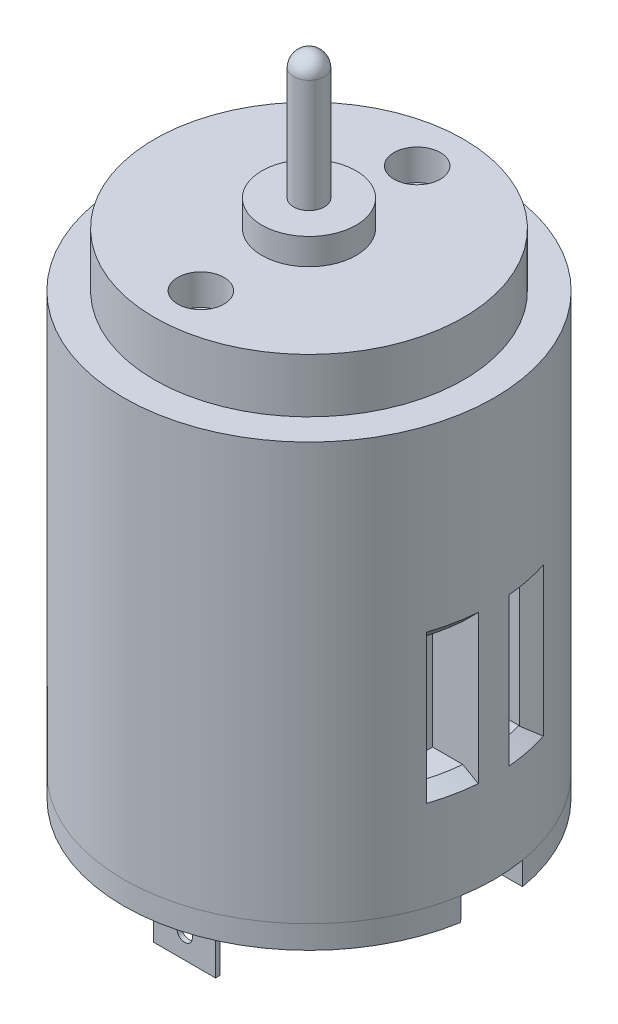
ISO-10303-21;
HEADER;
FILE_DESCRIPTION(('STEP AP214'),'2;1');
FILE_NAME('part.step','',(''),(''),'','','');
FILE_SCHEMA(('AUTOMOTIVE_DESIGN { 1 0 10303 214 1 1 1 1 }'));
ENDSEC;
DATA;
#1=APPLICATION_CONTEXT('core data for automotive mechanical design processes');
#2=APPLICATION_PROTOCOL_DEFINITION('international standard','automotive_design',2000,#1);
#3=PRODUCT_CONTEXT('',#1,'mechanical');
#4=PRODUCT('Part','Part','',(#3));
#5=PRODUCT_RELATED_PRODUCT_CATEGORY('part','',(#4));
#6=PRODUCT_DEFINITION_FORMATION('','',#4);
#7=PRODUCT_DEFINITION_CONTEXT('part definition',#1,'design');
#8=PRODUCT_DEFINITION('design','',#6,#7);
#9=PRODUCT_DEFINITION_SHAPE('','',#8);
#10=(LENGTH_UNIT() NAMED_UNIT(*) SI_UNIT(.MILLI.,.METRE.));
#11=(NAMED_UNIT(*) PLANE_ANGLE_UNIT() SI_UNIT($,.RADIAN.));
#12=(NAMED_UNIT(*) SI_UNIT($,.STERADIAN.) SOLID_ANGLE_UNIT());
#13=UNCERTAINTY_MEASURE_WITH_UNIT(LENGTH_MEASURE(1.E-05),#10,'distance_accuracy_value','');
#14=(GEOMETRIC_REPRESENTATION_CONTEXT(3) GLOBAL_UNCERTAINTY_ASSIGNED_CONTEXT((#13)) GLOBAL_UNIT_ASSIGNED_CONTEXT((#10,
#11,#12)) REPRESENTATION_CONTEXT('',''));
#15=CARTESIAN_POINT('',(0.,0.,0.));
#16=DIRECTION('',(0.,0.,1.));
#17=DIRECTION('',(1.,0.,0.));
#18=AXIS2_PLACEMENT_3D('',#15,#16,#17);
#19=CARTESIAN_POINT('',(0.,1.5,0.));
#20=DIRECTION('',(0.,-1.,0.));
#21=DIRECTION('',(0.,0.,-1.));
#22=AXIS2_PLACEMENT_3D('',#19,#20,#21);
#23=CYLINDRICAL_SURFACE('',#22,11.99);
#24=CARTESIAN_POINT('',(0.,0.,0.));
#25=DIRECTION('',(0.,1.,0.));
#26=DIRECTION('',(0.,0.,1.));
#27=AXIS2_PLACEMENT_3D('',#24,#25,#26);
#28=CIRCLE('',#27,11.99);
#29=CARTESIAN_POINT('',(-11.8220175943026,0.,2.));
#30=VERTEX_POINT('',#29);
#31=CARTESIAN_POINT('',(11.8220175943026,0.,2.));
#32=VERTEX_POINT('',#31);
#33=EDGE_CURVE('E690',#30,#32,#28,.T.);
#34=ORIENTED_EDGE('',*,*,#33,.T.);
#35=DIRECTION('',(0.,-1.,0.));
#36=VECTOR('',#35,1.);
#37=CARTESIAN_POINT('',(11.8220175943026,1.5,2.));
#38=LINE('',#37,#36);
#39=CARTESIAN_POINT('',(11.8270885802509,1.5,2.));
#40=VERTEX_POINT('',#39);
#41=EDGE_CURVE('E1001',#32,#40,#38,.F.);
#42=ORIENTED_EDGE('',*,*,#41,.T.);
#43=CARTESIAN_POINT('',(0.,1.5,0.));
#44=DIRECTION('',(0.,1.,0.));
#45=DIRECTION('',(-0.986001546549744,0.,0.166736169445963));
#46=AXIS2_PLACEMENT_3D('',#43,#44,#45);
#47=CIRCLE('',#46,12.);
#48=CARTESIAN_POINT('',(-11.8270885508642,1.5,2.00000035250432));
#49=VERTEX_POINT('',#48);
#50=EDGE_CURVE('E743',#49,#40,#47,.T.);
#51=ORIENTED_EDGE('',*,*,#50,.F.);
#52=DIRECTION('',(0.,-1.,0.));
#53=VECTOR('',#52,1.);
#54=CARTESIAN_POINT('',(-11.8220175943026,1.5,2.));
#55=LINE('',#54,#53);
#56=EDGE_CURVE('E442',#49,#30,#55,.T.);
#57=ORIENTED_EDGE('',*,*,#56,.T.);
#58=EDGE_LOOP('',(#34,#42,#51,#57));
#59=FACE_BOUND('',#58,.T.);
#60=ADVANCED_FACE('F30',(#59),#23,.T.);
#61=CARTESIAN_POINT('',(-15.5,15.9441554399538,-3.));
#62=DIRECTION('',(0.,0.,-1.));
#63=DIRECTION('',(-1.,0.,0.));
#64=AXIS2_PLACEMENT_3D('',#61,#62,#63);
#65=PLANE('',#64);
#66=CARTESIAN_POINT('',(-10.5830052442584,15.9441554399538,-3.));
#67=CARTESIAN_POINT('',(-10.7559277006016,16.1105476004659,-3.));
#68=CARTESIAN_POINT('',(-10.9287176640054,16.2770770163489,-3.));
#69=CARTESIAN_POINT('',(-11.2740325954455,16.6104103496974,-3.));
#70=CARTESIAN_POINT('',(-11.4465575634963,16.7772142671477,-3.));
#71=CARTESIAN_POINT('',(-11.6189500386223,16.9441554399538,-3.));
#72=B_SPLINE_CURVE_WITH_KNOTS('',3,(#66,#67,#68,#69,#70,#71),.UNSPECIFIED.,.F.,.F.,(4,2,4),(0.,
0.719927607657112,1.43985517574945),.UNSPECIFIED.);
#73=CARTESIAN_POINT('',(-10.5830052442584,15.9441554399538,-3.));
#74=VERTEX_POINT('',#73);
#75=CARTESIAN_POINT('',(-10.6189500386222,15.978741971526,-3.));
#76=VERTEX_POINT('',#75);
#77=EDGE_CURVE('E906',#74,#76,#72,.T.);
#78=ORIENTED_EDGE('',*,*,#77,.T.);
#79=DIRECTION('',(0.,-1.,0.));
#80=VECTOR('',#79,1.);
#81=CARTESIAN_POINT('',(-10.6189500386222,15.9441554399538,-3.));
#82=LINE('',#81,#80);
#83=CARTESIAN_POINT('',(-10.6189500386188,7.90320072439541,-3.));
#84=VERTEX_POINT('',#83);
#85=EDGE_CURVE('E1672',#76,#84,#82,.T.);
#86=ORIENTED_EDGE('',*,*,#85,.T.);
#87=CARTESIAN_POINT('',(-11.6189500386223,7.34581899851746,-3.));
#88=CARTESIAN_POINT('',(-11.446422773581,7.44227765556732,-3.));
#89=CARTESIAN_POINT('',(-11.2738304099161,7.53861950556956,-3.));
#90=CARTESIAN_POINT('',(-10.9285154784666,7.73106959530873,-3.));
#91=CARTESIAN_POINT('',(-10.7557929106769,7.82717783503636,-3.));
#92=CARTESIAN_POINT('',(-10.5830052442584,7.92316926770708,-3.));
#93=B_SPLINE_CURVE_WITH_KNOTS('',3,(#87,#88,#89,#90,#91,#92),.UNSPECIFIED.,.F.,.F.,(4,2,4),(0.,
0.592983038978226,1.18596610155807),.UNSPECIFIED.);
#94=CARTESIAN_POINT('',(-10.5830052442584,7.92316926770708,-3.));
#95=VERTEX_POINT('',#94);
#96=EDGE_CURVE('E913',#84,#95,#93,.T.);
#97=ORIENTED_EDGE('',*,*,#96,.T.);
#98=DIRECTION('',(1.,0.,0.));
#99=VECTOR('',#98,1.);
#100=CARTESIAN_POINT('',(-15.5,7.92316926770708,-3.));
#101=LINE('',#100,#99);
#102=CARTESIAN_POINT('',(-9.,7.92316926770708,-3.));
#103=VERTEX_POINT('',#102);
#104=EDGE_CURVE('E513',#95,#103,#101,.T.);
#105=ORIENTED_EDGE('',*,*,#104,.T.);
#106=DIRECTION('',(0.,-1.,0.));
#107=VECTOR('',#106,1.);
#108=CARTESIAN_POINT('',(-9.,15.9441554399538,-3.));
#109=LINE('',#108,#107);
#110=CARTESIAN_POINT('',(-9.,15.9441554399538,-3.));
#111=VERTEX_POINT('',#110);
#112=EDGE_CURVE('E476',#111,#103,#109,.T.);
#113=ORIENTED_EDGE('',*,*,#112,.F.);
#114=DIRECTION('',(1.,0.,0.));
#115=VECTOR('',#114,1.);
#116=CARTESIAN_POINT('',(-15.5,15.9441554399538,-3.));
#117=LINE('',#116,#115);
#118=EDGE_CURVE('E523',#74,#111,#117,.T.);
#119=ORIENTED_EDGE('',*,*,#118,.F.);
#120=EDGE_LOOP('',(#78,#86,#97,#105,#113,#119));
#121=FACE_BOUND('',#120,.T.);
#122=ADVANCED_FACE('F722',(#121),#65,.F.);
#123=CARTESIAN_POINT('',(-15.5,7.92316926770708,-3.));
#124=DIRECTION('',(0.,-1.,0.));
#125=DIRECTION('',(0.,0.,-1.));
#126=AXIS2_PLACEMENT_3D('',#123,#124,#125);
#127=PLANE('',#126);
#128=ORIENTED_EDGE('',*,*,#104,.F.);
#129=CARTESIAN_POINT('',(0.,7.92316926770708,0.));
#130=DIRECTION('',(0.,-1.,0.));
#131=DIRECTION('',(0.,0.,-1.));
#132=AXIS2_PLACEMENT_3D('',#129,#130,#131);
#133=CIRCLE('',#132,11.);
#134=CARTESIAN_POINT('',(-10.9544511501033,7.92316926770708,-1.));
#135=VERTEX_POINT('',#134);
#136=EDGE_CURVE('E1782',#95,#135,#133,.F.);
#137=ORIENTED_EDGE('',*,*,#136,.T.);
#138=DIRECTION('',(1.,0.,0.));
#139=VECTOR('',#138,1.);
#140=CARTESIAN_POINT('',(-15.5,7.92316926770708,-1.));
#141=LINE('',#140,#139);
#142=CARTESIAN_POINT('',(-9.,7.92316926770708,-1.));
#143=VERTEX_POINT('',#142);
#144=EDGE_CURVE('E517',#135,#143,#141,.T.);
#145=ORIENTED_EDGE('',*,*,#144,.T.);
#146=DIRECTION('',(0.,0.,1.));
#147=VECTOR('',#146,1.);
#148=CARTESIAN_POINT('',(-9.,7.92316926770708,-3.));
#149=LINE('',#148,#147);
#150=EDGE_CURVE('E473',#103,#143,#149,.T.);
#151=ORIENTED_EDGE('',*,*,#150,.F.);
#152=EDGE_LOOP('',(#128,#137,#145,#151));
#153=FACE_BOUND('',#152,.T.);
#154=ADVANCED_FACE('F727',(#153),#127,.F.);
#155=CARTESIAN_POINT('',(-15.5,15.9441554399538,-1.));
#156=DIRECTION('',(0.,0.,1.));
#157=DIRECTION('',(0.,-1.,0.));
#158=AXIS2_PLACEMENT_3D('',#155,#156,#157);
#159=PLANE('',#158);
#160=DIRECTION('',(0.,1.,0.));
#161=VECTOR('',#160,1.);
#162=CARTESIAN_POINT('',(-9.,15.9441554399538,-1.));
#163=LINE('',#162,#161);
#164=CARTESIAN_POINT('',(-9.,15.9441554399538,-1.));
#165=VERTEX_POINT('',#164);
#166=EDGE_CURVE('E470',#143,#165,#163,.T.);
#167=ORIENTED_EDGE('',*,*,#166,.F.);
#168=ORIENTED_EDGE('',*,*,#144,.F.);
#169=CARTESIAN_POINT('',(-10.9544511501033,7.92316926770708,-1.));
#170=CARTESIAN_POINT('',(-11.1217665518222,7.82696822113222,-1.));
#171=CARTESIAN_POINT('',(-11.2890750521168,7.73075517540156,-1.));
#172=CARTESIAN_POINT('',(-11.6236782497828,7.53830508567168,-1.));
#173=CARTESIAN_POINT('',(-11.7909729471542,7.44206804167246,-1.));
#174=CARTESIAN_POINT('',(-11.9582607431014,7.34581899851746,-1.));
#175=B_SPLINE_CURVE_WITH_KNOTS('',3,(#169,#170,#171,#172,#173,#174),.UNSPECIFIED.,.F.,.F.,(4,2,
4),(0.,0.579000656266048,1.1580013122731),.UNSPECIFIED.);
#176=CARTESIAN_POINT('',(-11.9582607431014,7.34581899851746,-1.));
#177=VERTEX_POINT('',#176);
#178=EDGE_CURVE('E920',#135,#177,#175,.T.);
#179=ORIENTED_EDGE('',*,*,#178,.T.);
#180=DIRECTION('',(0.,-1.,0.));
#181=VECTOR('',#180,1.);
#182=CARTESIAN_POINT('',(-11.9582607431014,28.5,-1.));
#183=LINE('',#182,#181);
#184=CARTESIAN_POINT('',(-11.9582607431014,16.9441554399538,-1.));
#185=VERTEX_POINT('',#184);
#186=EDGE_CURVE('E783',#185,#177,#183,.T.);
#187=ORIENTED_EDGE('',*,*,#186,.F.);
#188=CARTESIAN_POINT('',(-11.9582607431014,16.9441554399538,-1.));
#189=CARTESIAN_POINT('',(-11.7909868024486,16.7774610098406,-1.));
#190=CARTESIAN_POINT('',(-11.6236990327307,16.6107804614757,-1.));
#191=CARTESIAN_POINT('',(-11.2890958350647,16.2774471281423,-1.));
#192=CARTESIAN_POINT('',(-11.1217804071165,16.110794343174,-1.));
#193=CARTESIAN_POINT('',(-10.9544511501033,15.9441554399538,-1.));
#194=B_SPLINE_CURVE_WITH_KNOTS('',3,(#188,#189,#190,#191,#192,#193),.UNSPECIFIED.,.F.,.F.,(4,2,
4),(0.,0.708454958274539,1.41690991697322),.UNSPECIFIED.);
#195=CARTESIAN_POINT('',(-10.9544511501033,15.9441554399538,-1.));
#196=VERTEX_POINT('',#195);
#197=EDGE_CURVE('E1635',#185,#196,#194,.T.);
#198=ORIENTED_EDGE('',*,*,#197,.T.);
#199=DIRECTION('',(1.,0.,0.));
#200=VECTOR('',#199,1.);
#201=CARTESIAN_POINT('',(-15.5,15.9441554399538,-1.));
#202=LINE('',#201,#200);
#203=EDGE_CURVE('E520',#196,#165,#202,.T.);
#204=ORIENTED_EDGE('',*,*,#203,.T.);
#205=EDGE_LOOP('',(#167,#168,#179,#187,#198,#204));
#206=FACE_BOUND('',#205,.T.);
#207=ADVANCED_FACE('F1145',(#206),#159,.F.);
#208=CARTESIAN_POINT('',(-15.5,15.9441554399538,-1.));
#209=DIRECTION('',(0.,1.,0.));
#210=DIRECTION('',(0.,0.,1.));
#211=AXIS2_PLACEMENT_3D('',#208,#209,#210);
#212=PLANE('',#211);
#213=ORIENTED_EDGE('',*,*,#203,.F.);
#214=CARTESIAN_POINT('',(0.,15.9441554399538,0.));
#215=DIRECTION('',(0.,1.,0.));
#216=DIRECTION('',(0.,0.,1.));
#217=AXIS2_PLACEMENT_3D('',#214,#215,#216);
#218=CIRCLE('',#217,11.);
#219=EDGE_CURVE('E1636',#196,#74,#218,.F.);
#220=ORIENTED_EDGE('',*,*,#219,.T.);
#221=ORIENTED_EDGE('',*,*,#118,.T.);
#222=DIRECTION('',(0.,0.,-1.));
#223=VECTOR('',#222,1.);
#224=CARTESIAN_POINT('',(-9.,15.9441554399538,-1.));
#225=LINE('',#224,#223);
#226=EDGE_CURVE('E467',#165,#111,#225,.T.);
#227=ORIENTED_EDGE('',*,*,#226,.F.);
#228=EDGE_LOOP('',(#213,#220,#221,#227));
#229=FACE_BOUND('',#228,.T.);
#230=ADVANCED_FACE('F1139',(#229),#212,.F.);
#231=CARTESIAN_POINT('',(-15.5,15.9441554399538,3.));
#232=DIRECTION('',(0.,0.,1.));
#233=DIRECTION('',(0.,-1.,0.));
#234=AXIS2_PLACEMENT_3D('',#231,#232,#233);
#235=PLANE('',#234);
#236=CARTESIAN_POINT('',(-10.5830052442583,7.92316926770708,3.));
#237=CARTESIAN_POINT('',(-10.7557929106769,7.82717783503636,3.));
#238=CARTESIAN_POINT('',(-10.9285154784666,7.73106959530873,3.));
#239=CARTESIAN_POINT('',(-11.273830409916,7.53861950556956,3.));
#240=CARTESIAN_POINT('',(-11.446422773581,7.44227765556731,3.));
#241=CARTESIAN_POINT('',(-11.6189500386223,7.34581899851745,3.));
#242=B_SPLINE_CURVE_WITH_KNOTS('',3,(#236,#237,#238,#239,#240,#241),.UNSPECIFIED.,.F.,.F.,(4,2,
4),(0.,0.592983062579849,1.18596610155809),.UNSPECIFIED.);
#243=CARTESIAN_POINT('',(-10.5830052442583,7.92316926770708,3.));
#244=VERTEX_POINT('',#243);
#245=CARTESIAN_POINT('',(-10.6189500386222,7.9032007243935,3.));
#246=VERTEX_POINT('',#245);
#247=EDGE_CURVE('E1753',#244,#246,#242,.T.);
#248=ORIENTED_EDGE('',*,*,#247,.T.);
#249=DIRECTION('',(0.,1.,0.));
#250=VECTOR('',#249,1.);
#251=CARTESIAN_POINT('',(-10.6189500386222,15.9441554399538,3.));
#252=LINE('',#251,#250);
#253=CARTESIAN_POINT('',(-10.6189500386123,15.9787419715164,3.));
#254=VERTEX_POINT('',#253);
#255=EDGE_CURVE('E1673',#246,#254,#252,.T.);
#256=ORIENTED_EDGE('',*,*,#255,.T.);
#257=CARTESIAN_POINT('',(-11.6189500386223,16.9441554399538,3.));
#258=CARTESIAN_POINT('',(-11.4465575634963,16.7772142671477,3.));
#259=CARTESIAN_POINT('',(-11.2740325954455,16.6104103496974,3.));
#260=CARTESIAN_POINT('',(-10.9287176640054,16.2770770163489,3.));
#261=CARTESIAN_POINT('',(-10.7559277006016,16.1105476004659,3.));
#262=CARTESIAN_POINT('',(-10.5830052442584,15.9441554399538,3.));
#263=B_SPLINE_CURVE_WITH_KNOTS('',3,(#257,#258,#259,#260,#261,#262),.UNSPECIFIED.,.F.,.F.,(4,2,
4),(0.,0.719927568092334,1.43985517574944),.UNSPECIFIED.);
#264=CARTESIAN_POINT('',(-10.5830052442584,15.9441554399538,3.));
#265=VERTEX_POINT('',#264);
#266=EDGE_CURVE('E1747',#254,#265,#263,.T.);
#267=ORIENTED_EDGE('',*,*,#266,.T.);
#268=DIRECTION('',(1.,0.,0.));
#269=VECTOR('',#268,1.);
#270=CARTESIAN_POINT('',(-15.5,15.9441554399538,3.));
#271=LINE('',#270,#269);
#272=CARTESIAN_POINT('',(-9.,15.9441554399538,3.));
#273=VERTEX_POINT('',#272);
#274=EDGE_CURVE('E501',#265,#273,#271,.T.);
#275=ORIENTED_EDGE('',*,*,#274,.T.);
#276=DIRECTION('',(0.,1.,0.));
#277=VECTOR('',#276,1.);
#278=CARTESIAN_POINT('',(-9.,15.9441554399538,3.));
#279=LINE('',#278,#277);
#280=CARTESIAN_POINT('',(-9.,7.92316926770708,3.));
#281=VERTEX_POINT('',#280);
#282=EDGE_CURVE('E464',#281,#273,#279,.T.);
#283=ORIENTED_EDGE('',*,*,#282,.F.);
#284=DIRECTION('',(1.,0.,0.));
#285=VECTOR('',#284,1.);
#286=CARTESIAN_POINT('',(-15.5,7.92316926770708,3.));
#287=LINE('',#286,#285);
#288=EDGE_CURVE('E511',#244,#281,#287,.T.);
#289=ORIENTED_EDGE('',*,*,#288,.F.);
#290=EDGE_LOOP('',(#248,#256,#267,#275,#283,#289));
#291=FACE_BOUND('',#290,.T.);
#292=ADVANCED_FACE('F1132',(#291),#235,.F.);
#293=CARTESIAN_POINT('',(-15.5,15.9441554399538,3.));
#294=DIRECTION('',(0.,1.,0.));
#295=DIRECTION('',(0.,0.,1.));
#296=AXIS2_PLACEMENT_3D('',#293,#294,#295);
#297=PLANE('',#296);
#298=ORIENTED_EDGE('',*,*,#274,.F.);
#299=CARTESIAN_POINT('',(0.,15.9441554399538,0.));
#300=DIRECTION('',(0.,1.,0.));
#301=DIRECTION('',(0.,0.,1.));
#302=AXIS2_PLACEMENT_3D('',#299,#300,#301);
#303=CIRCLE('',#302,11.);
#304=CARTESIAN_POINT('',(-10.9544511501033,15.9441554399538,1.));
#305=VERTEX_POINT('',#304);
#306=EDGE_CURVE('E1633',#265,#305,#303,.F.);
#307=ORIENTED_EDGE('',*,*,#306,.T.);
#308=DIRECTION('',(1.,0.,0.));
#309=VECTOR('',#308,1.);
#310=CARTESIAN_POINT('',(-15.5,15.9441554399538,1.));
#311=LINE('',#310,#309);
#312=CARTESIAN_POINT('',(-9.,15.9441554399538,1.));
#313=VERTEX_POINT('',#312);
#314=EDGE_CURVE('E505',#305,#313,#311,.T.);
#315=ORIENTED_EDGE('',*,*,#314,.T.);
#316=DIRECTION('',(0.,0.,-1.));
#317=VECTOR('',#316,1.);
#318=CARTESIAN_POINT('',(-9.,15.9441554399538,3.));
#319=LINE('',#318,#317);
#320=EDGE_CURVE('E461',#273,#313,#319,.T.);
#321=ORIENTED_EDGE('',*,*,#320,.F.);
#322=EDGE_LOOP('',(#298,#307,#315,#321));
#323=FACE_BOUND('',#322,.T.);
#324=ADVANCED_FACE('F1125',(#323),#297,.F.);
#325=CARTESIAN_POINT('',(-15.5,15.9441554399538,1.));
#326=DIRECTION('',(0.,0.,-1.));
#327=DIRECTION('',(-1.,0.,0.));
#328=AXIS2_PLACEMENT_3D('',#325,#326,#327);
#329=PLANE('',#328);
#330=DIRECTION('',(0.,-1.,0.));
#331=VECTOR('',#330,1.);
#332=CARTESIAN_POINT('',(-9.,15.9441554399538,1.));
#333=LINE('',#332,#331);
#334=CARTESIAN_POINT('',(-9.,7.92316926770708,1.));
#335=VERTEX_POINT('',#334);
#336=EDGE_CURVE('E456',#313,#335,#333,.T.);
#337=ORIENTED_EDGE('',*,*,#336,.F.);
#338=ORIENTED_EDGE('',*,*,#314,.F.);
#339=CARTESIAN_POINT('',(-10.9544511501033,15.9441554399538,1.));
#340=CARTESIAN_POINT('',(-11.1217804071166,16.110794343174,1.));
#341=CARTESIAN_POINT('',(-11.2890958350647,16.2774471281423,1.));
#342=CARTESIAN_POINT('',(-11.6236990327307,16.6107804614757,1.));
#343=CARTESIAN_POINT('',(-11.7909868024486,16.7774610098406,1.));
#344=CARTESIAN_POINT('',(-11.9582607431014,16.9441554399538,1.));
#345=B_SPLINE_CURVE_WITH_KNOTS('',3,(#339,#340,#341,#342,#343,#344),.UNSPECIFIED.,.F.,.F.,(4,2,
4),(0.,0.708454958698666,1.4169099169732),.UNSPECIFIED.);
#346=CARTESIAN_POINT('',(-11.9582607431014,16.9441554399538,1.));
#347=VERTEX_POINT('',#346);
#348=EDGE_CURVE('E1786',#305,#347,#345,.T.);
#349=ORIENTED_EDGE('',*,*,#348,.T.);
#350=DIRECTION('',(0.,-1.,0.));
#351=VECTOR('',#350,1.);
#352=CARTESIAN_POINT('',(-11.9582607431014,28.5,1.));
#353=LINE('',#352,#351);
#354=CARTESIAN_POINT('',(-11.9582607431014,7.34581899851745,1.));
#355=VERTEX_POINT('',#354);
#356=EDGE_CURVE('E787',#355,#347,#353,.F.);
#357=ORIENTED_EDGE('',*,*,#356,.F.);
#358=CARTESIAN_POINT('',(-11.9582607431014,7.34581899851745,1.));
#359=CARTESIAN_POINT('',(-11.7909729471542,7.44206804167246,1.));
#360=CARTESIAN_POINT('',(-11.6236782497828,7.53830508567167,1.));
#361=CARTESIAN_POINT('',(-11.2890750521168,7.73075517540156,1.));
#362=CARTESIAN_POINT('',(-11.1217665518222,7.82696822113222,1.));
#363=CARTESIAN_POINT('',(-10.9544511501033,7.92316926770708,1.));
#364=B_SPLINE_CURVE_WITH_KNOTS('',3,(#358,#359,#360,#361,#362,#363),.UNSPECIFIED.,.F.,.F.,(4,2,
4),(0.,0.579000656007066,1.15800131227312),.UNSPECIFIED.);
#365=CARTESIAN_POINT('',(-10.9544511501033,7.92316926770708,1.));
#366=VERTEX_POINT('',#365);
#367=EDGE_CURVE('E1758',#355,#366,#364,.T.);
#368=ORIENTED_EDGE('',*,*,#367,.T.);
#369=DIRECTION('',(1.,0.,0.));
#370=VECTOR('',#369,1.);
#371=CARTESIAN_POINT('',(-15.5,7.92316926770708,1.));
#372=LINE('',#371,#370);
#373=EDGE_CURVE('E508',#366,#335,#372,.T.);
#374=ORIENTED_EDGE('',*,*,#373,.T.);
#375=EDGE_LOOP('',(#337,#338,#349,#357,#368,#374));
#376=FACE_BOUND('',#375,.T.);
#377=ADVANCED_FACE('F717',(#376),#329,.F.);
#378=CARTESIAN_POINT('',(-15.5,7.92316926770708,1.));
#379=DIRECTION('',(0.,-1.,0.));
#380=DIRECTION('',(0.,0.,-1.));
#381=AXIS2_PLACEMENT_3D('',#378,#379,#380);
#382=PLANE('',#381);
#383=ORIENTED_EDGE('',*,*,#373,.F.);
#384=CARTESIAN_POINT('',(0.,7.92316926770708,0.));
#385=DIRECTION('',(0.,-1.,0.));
#386=DIRECTION('',(0.,0.,-1.));
#387=AXIS2_PLACEMENT_3D('',#384,#385,#386);
#388=CIRCLE('',#387,11.);
#389=EDGE_CURVE('E921',#366,#244,#388,.F.);
#390=ORIENTED_EDGE('',*,*,#389,.T.);
#391=ORIENTED_EDGE('',*,*,#288,.T.);
#392=DIRECTION('',(0.,0.,1.));
#393=VECTOR('',#392,1.);
#394=CARTESIAN_POINT('',(-9.,7.92316926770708,1.));
#395=LINE('',#394,#393);
#396=EDGE_CURVE('E791',#335,#281,#395,.T.);
#397=ORIENTED_EDGE('',*,*,#396,.F.);
#398=EDGE_LOOP('',(#383,#390,#391,#397));
#399=FACE_BOUND('',#398,.T.);
#400=ADVANCED_FACE('F708',(#399),#382,.F.);
#401=CARTESIAN_POINT('',(0.,0.,0.));
#402=DIRECTION('',(0.,1.,0.));
#403=DIRECTION('',(0.,0.,1.));
#404=AXIS2_PLACEMENT_3D('',#401,#402,#403);
#405=PLANE('',#404);
#406=DIRECTION('',(0.,0.,1.));
#407=VECTOR('',#406,1.);
#408=CARTESIAN_POINT('',(2.,0.,8.05));
#409=LINE('',#408,#407);
#410=CARTESIAN_POINT('',(2.,0.,7.75));
#411=VERTEX_POINT('',#410);
#412=CARTESIAN_POINT('',(2.,0.,8.05));
#413=VERTEX_POINT('',#412);
#414=EDGE_CURVE('E609',#411,#413,#409,.T.);
#415=ORIENTED_EDGE('',*,*,#414,.F.);
#416=DIRECTION('',(1.,0.,0.));
#417=VECTOR('',#416,1.);
#418=CARTESIAN_POINT('',(0.,0.,7.75));
#419=LINE('',#418,#417);
#420=CARTESIAN_POINT('',(-2.,0.,7.75));
#421=VERTEX_POINT('',#420);
#422=EDGE_CURVE('E618',#421,#411,#419,.T.);
#423=ORIENTED_EDGE('',*,*,#422,.F.);
#424=DIRECTION('',(0.,0.,-1.));
#425=VECTOR('',#424,1.);
#426=CARTESIAN_POINT('',(-2.,0.,8.05));
#427=LINE('',#426,#425);
#428=CARTESIAN_POINT('',(-2.,0.,8.05));
#429=VERTEX_POINT('',#428);
#430=EDGE_CURVE('E615',#429,#421,#427,.T.);
#431=ORIENTED_EDGE('',*,*,#430,.F.);
#432=DIRECTION('',(-1.,0.,0.));
#433=VECTOR('',#432,1.);
#434=CARTESIAN_POINT('',(0.,0.,8.05));
#435=LINE('',#434,#433);
#436=EDGE_CURVE('E612',#413,#429,#435,.T.);
#437=ORIENTED_EDGE('',*,*,#436,.F.);
#438=EDGE_LOOP('',(#415,#423,#431,#437));
#439=FACE_BOUND('',#438,.T.);
#440=CARTESIAN_POINT('',(8.01,0.,0.));
#441=DIRECTION('',(0.,-1.,0.));
#442=DIRECTION('',(0.,0.,-1.));
#443=AXIS2_PLACEMENT_3D('',#440,#441,#442);
#444=CIRCLE('',#443,2.);
#445=CARTESIAN_POINT('',(8.01,0.,2.));
#446=VERTEX_POINT('',#445);
#447=CARTESIAN_POINT('',(8.01,0.,-2.));
#448=VERTEX_POINT('',#447);
#449=EDGE_CURVE('E377',#446,#448,#444,.T.);
#450=ORIENTED_EDGE('',*,*,#449,.F.);
#451=DIRECTION('',(-1.,0.,0.));
#452=VECTOR('',#451,1.);
#453=CARTESIAN_POINT('',(8.01,0.,2.));
#454=LINE('',#453,#452);
#455=EDGE_CURVE('E388',#32,#446,#454,.T.);
#456=ORIENTED_EDGE('',*,*,#455,.F.);
#457=ORIENTED_EDGE('',*,*,#33,.F.);
#458=DIRECTION('',(-1.,0.,0.));
#459=VECTOR('',#458,1.);
#460=CARTESIAN_POINT('',(-8.01,0.,2.));
#461=LINE('',#460,#459);
#462=CARTESIAN_POINT('',(-8.01,0.,2.));
#463=VERTEX_POINT('',#462);
#464=EDGE_CURVE('E987',#463,#30,#461,.T.);
#465=ORIENTED_EDGE('',*,*,#464,.F.);
#466=CARTESIAN_POINT('',(-8.01,0.,0.));
#467=DIRECTION('',(0.,-1.,0.));
#468=DIRECTION('',(0.,0.,-1.));
#469=AXIS2_PLACEMENT_3D('',#466,#467,#468);
#470=CIRCLE('',#469,2.);
#471=CARTESIAN_POINT('',(-8.01,0.,-2.));
#472=VERTEX_POINT('',#471);
#473=EDGE_CURVE('E998',#472,#463,#470,.T.);
#474=ORIENTED_EDGE('',*,*,#473,.F.);
#475=DIRECTION('',(1.,0.,0.));
#476=VECTOR('',#475,1.);
#477=CARTESIAN_POINT('',(-8.01,0.,-2.));
#478=LINE('',#477,#476);
#479=CARTESIAN_POINT('',(-11.8220175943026,0.,-2.));
#480=VERTEX_POINT('',#479);
#481=EDGE_CURVE('E985',#480,#472,#478,.T.);
#482=ORIENTED_EDGE('',*,*,#481,.F.);
#483=CARTESIAN_POINT('',(11.8220175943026,0.,-2.));
#484=VERTEX_POINT('',#483);
#485=EDGE_CURVE('E387',#484,#480,#28,.T.);
#486=ORIENTED_EDGE('',*,*,#485,.F.);
#487=DIRECTION('',(1.,0.,0.));
#488=VECTOR('',#487,1.);
#489=CARTESIAN_POINT('',(8.01,0.,-2.));
#490=LINE('',#489,#488);
#491=EDGE_CURVE('E368',#448,#484,#490,.T.);
#492=ORIENTED_EDGE('',*,*,#491,.F.);
#493=EDGE_LOOP('',(#450,#456,#457,#465,#474,#482,#486,#492));
#494=FACE_BOUND('',#493,.T.);
#495=CARTESIAN_POINT('',(0.,0.,0.));
#496=DIRECTION('',(0.,1.,0.));
#497=DIRECTION('',(0.,0.,1.));
#498=AXIS2_PLACEMENT_3D('',#495,#496,#497);
#499=CIRCLE('',#498,3.1);
#500=CARTESIAN_POINT('',(0.,0.,3.1));
#501=VERTEX_POINT('',#500);
#502=EDGE_CURVE('E750',#501,#501,#499,.F.);
#503=ORIENTED_EDGE('',*,*,#502,.F.);
#504=EDGE_LOOP('',(#503));
#505=FACE_BOUND('',#504,.T.);
#506=DIRECTION('',(0.,0.,1.));
#507=VECTOR('',#506,1.);
#508=CARTESIAN_POINT('',(2.,0.,-7.75));
#509=LINE('',#508,#507);
#510=CARTESIAN_POINT('',(2.,0.,-8.05));
#511=VERTEX_POINT('',#510);
#512=CARTESIAN_POINT('',(2.,0.,-7.75));
#513=VERTEX_POINT('',#512);
#514=EDGE_CURVE('E576',#511,#513,#509,.T.);
#515=ORIENTED_EDGE('',*,*,#514,.F.);
#516=DIRECTION('',(1.,0.,0.));
#517=VECTOR('',#516,1.);
#518=CARTESIAN_POINT('',(0.,0.,-8.05));
#519=LINE('',#518,#517);
#520=CARTESIAN_POINT('',(-2.,0.,-8.05));
#521=VERTEX_POINT('',#520);
#522=EDGE_CURVE('E585',#521,#511,#519,.T.);
#523=ORIENTED_EDGE('',*,*,#522,.F.);
#524=DIRECTION('',(0.,0.,-1.));
#525=VECTOR('',#524,1.);
#526=CARTESIAN_POINT('',(-2.,0.,-7.75));
#527=LINE('',#526,#525);
#528=CARTESIAN_POINT('',(-2.,0.,-7.75));
#529=VERTEX_POINT('',#528);
#530=EDGE_CURVE('E582',#529,#521,#527,.T.);
#531=ORIENTED_EDGE('',*,*,#530,.F.);
#532=DIRECTION('',(-1.,0.,0.));
#533=VECTOR('',#532,1.);
#534=CARTESIAN_POINT('',(0.,0.,-7.75));
#535=LINE('',#534,#533);
#536=EDGE_CURVE('E579',#513,#529,#535,.T.);
#537=ORIENTED_EDGE('',*,*,#536,.F.);
#538=EDGE_LOOP('',(#515,#523,#531,#537));
#539=FACE_BOUND('',#538,.T.);
#540=ADVANCED_FACE('F384',(#439,#494,#505,#539),#405,.F.);
#541=CARTESIAN_POINT('',(0.,0.,0.));
#542=DIRECTION('',(0.,-1.,0.));
#543=DIRECTION('',(0.,0.,-1.));
#544=AXIS2_PLACEMENT_3D('',#541,#542,#543);
#545=PLANE('',#544);
#546=CARTESIAN_POINT('',(0.,0.,0.));
#547=DIRECTION('',(0.,-1.,0.));
#548=DIRECTION('',(0.,0.,-1.));
#549=AXIS2_PLACEMENT_3D('',#546,#547,#548);
#550=CIRCLE('',#549,1.25);
#551=CARTESIAN_POINT('',(0.,0.,-1.25));
#552=VERTEX_POINT('',#551);
#553=EDGE_CURVE('E660',#552,#552,#550,.T.);
#554=ORIENTED_EDGE('',*,*,#553,.T.);
#555=EDGE_LOOP('',(#554));
#556=FACE_BOUND('',#555,.T.);
#557=CARTESIAN_POINT('',(0.,0.,0.));
#558=DIRECTION('',(0.,-1.,0.));
#559=DIRECTION('',(0.,0.,-1.));
#560=AXIS2_PLACEMENT_3D('',#557,#558,#559);
#561=CIRCLE('',#560,1.);
#562=CARTESIAN_POINT('',(0.,0.,-1.));
#563=VERTEX_POINT('',#562);
#564=EDGE_CURVE('E654',#563,#563,#561,.T.);
#565=ORIENTED_EDGE('',*,*,#564,.F.);
#566=EDGE_LOOP('',(#565));
#567=FACE_BOUND('',#566,.T.);
#568=ADVANCED_FACE('F707',(#556,#567),#545,.T.);
#569=CARTESIAN_POINT('',(0.,33.7,0.));
#570=DIRECTION('',(0.,1.,0.));
#571=DIRECTION('',(0.,0.,1.));
#572=AXIS2_PLACEMENT_3D('',#569,#570,#571);
#573=PLANE('',#572);
#574=CARTESIAN_POINT('',(0.,33.7,0.));
#575=DIRECTION('',(0.,1.,0.));
#576=DIRECTION('',(0.,0.,1.));
#577=AXIS2_PLACEMENT_3D('',#574,#575,#576);
#578=CIRCLE('',#577,3.05);
#579=CARTESIAN_POINT('',(0.,33.7,3.05));
#580=VERTEX_POINT('',#579);
#581=EDGE_CURVE('E669',#580,#580,#578,.T.);
#582=ORIENTED_EDGE('',*,*,#581,.T.);
#583=EDGE_LOOP('',(#582));
#584=FACE_BOUND('',#583,.T.);
#585=CARTESIAN_POINT('',(0.,33.7,0.));
#586=DIRECTION('',(0.,1.,0.));
#587=DIRECTION('',(0.,0.,1.));
#588=AXIS2_PLACEMENT_3D('',#585,#586,#587);
#589=CIRCLE('',#588,1.);
#590=CARTESIAN_POINT('',(0.,33.7,-1.));
#591=VERTEX_POINT('',#590);
#592=EDGE_CURVE('E663',#591,#591,#589,.T.);
#593=ORIENTED_EDGE('',*,*,#592,.F.);
#594=EDGE_LOOP('',(#593));
#595=FACE_BOUND('',#594,.T.);
#596=ADVANCED_FACE('F714',(#584,#595),#573,.T.);
#597=CARTESIAN_POINT('',(0.,32.,0.));
#598=DIRECTION('',(0.,1.,0.));
#599=DIRECTION('',(0.,0.,1.));
#600=AXIS2_PLACEMENT_3D('',#597,#598,#599);
#601=PLANE('',#600);
#602=CARTESIAN_POINT('',(0.,32.,-7.));
#603=DIRECTION('',(0.,1.,0.));
#604=DIRECTION('',(0.,0.,1.));
#605=AXIS2_PLACEMENT_3D('',#602,#603,#604);
#606=CIRCLE('',#605,1.5);
#607=CARTESIAN_POINT('',(0.,32.,-5.5));
#608=VERTEX_POINT('',#607);
#609=EDGE_CURVE('E642',#608,#608,#606,.T.);
#610=ORIENTED_EDGE('',*,*,#609,.F.);
#611=EDGE_LOOP('',(#610));
#612=FACE_BOUND('',#611,.T.);
#613=CARTESIAN_POINT('',(0.,32.,7.));
#614=DIRECTION('',(0.,1.,0.));
#615=DIRECTION('',(0.,0.,1.));
#616=AXIS2_PLACEMENT_3D('',#613,#614,#615);
#617=CIRCLE('',#616,1.5);
#618=CARTESIAN_POINT('',(0.,32.,8.5));
#619=VERTEX_POINT('',#618);
#620=EDGE_CURVE('E648',#619,#619,#617,.T.);
#621=ORIENTED_EDGE('',*,*,#620,.F.);
#622=EDGE_LOOP('',(#621));
#623=FACE_BOUND('',#622,.T.);
#624=CARTESIAN_POINT('',(0.,32.,0.));
#625=DIRECTION('',(0.,1.,0.));
#626=DIRECTION('',(0.,0.,1.));
#627=AXIS2_PLACEMENT_3D('',#624,#625,#626);
#628=CIRCLE('',#627,10.);
#629=CARTESIAN_POINT('',(0.,32.,10.));
#630=VERTEX_POINT('',#629);
#631=EDGE_CURVE('E675',#630,#630,#628,.T.);
#632=ORIENTED_EDGE('',*,*,#631,.T.);
#633=EDGE_LOOP('',(#632));
#634=FACE_BOUND('',#633,.T.);
#635=CARTESIAN_POINT('',(0.,32.,0.));
#636=DIRECTION('',(0.,1.,0.));
#637=DIRECTION('',(0.,0.,1.));
#638=AXIS2_PLACEMENT_3D('',#635,#636,#637);
#639=CIRCLE('',#638,3.05);
#640=CARTESIAN_POINT('',(0.,32.,3.05));
#641=VERTEX_POINT('',#640);
#642=EDGE_CURVE('E666',#641,#641,#639,.T.);
#643=ORIENTED_EDGE('',*,*,#642,.F.);
#644=EDGE_LOOP('',(#643));
#645=FACE_BOUND('',#644,.T.);
#646=ADVANCED_FACE('F737',(#612,#623,#634,#645),#601,.T.);
#647=CARTESIAN_POINT('',(0.,28.5,0.));
#648=DIRECTION('',(0.,1.,0.));
#649=DIRECTION('',(0.,0.,1.));
#650=AXIS2_PLACEMENT_3D('',#647,#648,#649);
#651=PLANE('',#650);
#652=CARTESIAN_POINT('',(0.,28.5,0.));
#653=DIRECTION('',(0.,1.,0.));
#654=DIRECTION('',(0.,0.,1.));
#655=AXIS2_PLACEMENT_3D('',#652,#653,#654);
#656=CIRCLE('',#655,12.);
#657=CARTESIAN_POINT('',(0.,28.5,12.));
#658=VERTEX_POINT('',#657);
#659=EDGE_CURVE('E678',#658,#658,#656,.T.);
#660=ORIENTED_EDGE('',*,*,#659,.T.);
#661=EDGE_LOOP('',(#660));
#662=FACE_BOUND('',#661,.T.);
#663=CARTESIAN_POINT('',(0.,28.5,0.));
#664=DIRECTION('',(0.,1.,0.));
#665=DIRECTION('',(0.,0.,1.));
#666=AXIS2_PLACEMENT_3D('',#663,#664,#665);
#667=CIRCLE('',#666,10.);
#668=CARTESIAN_POINT('',(0.,28.5,10.));
#669=VERTEX_POINT('',#668);
#670=EDGE_CURVE('E672',#669,#669,#667,.T.);
#671=ORIENTED_EDGE('',*,*,#670,.F.);
#672=EDGE_LOOP('',(#671));
#673=FACE_BOUND('',#672,.T.);
#674=ADVANCED_FACE('F704',(#662,#673),#651,.T.);
#675=CARTESIAN_POINT('',(0.,1.5,0.));
#676=DIRECTION('',(0.,1.,0.));
#677=DIRECTION('',(0.986001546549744,0.,-0.166736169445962));
#678=AXIS2_PLACEMENT_3D('',#675,#676,#677);
#679=CIRCLE('',#678,12.);
#680=CARTESIAN_POINT('',(11.8270885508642,1.5,-2.00000035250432));
#681=VERTEX_POINT('',#680);
#682=CARTESIAN_POINT('',(-11.8270885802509,1.5,-2.));
#683=VERTEX_POINT('',#682);
#684=EDGE_CURVE('E739',#681,#683,#679,.T.);
#685=ORIENTED_EDGE('',*,*,#684,.F.);
#686=DIRECTION('',(0.,-1.,0.));
#687=VECTOR('',#686,1.);
#688=CARTESIAN_POINT('',(11.8220175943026,1.5,-2.));
#689=LINE('',#688,#687);
#690=EDGE_CURVE('E409',#681,#484,#689,.T.);
#691=ORIENTED_EDGE('',*,*,#690,.T.);
#692=ORIENTED_EDGE('',*,*,#485,.T.);
#693=DIRECTION('',(0.,-1.,0.));
#694=VECTOR('',#693,1.);
#695=CARTESIAN_POINT('',(-11.8220175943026,1.5,-2.));
#696=LINE('',#695,#694);
#697=EDGE_CURVE('E450',#480,#683,#696,.F.);
#698=ORIENTED_EDGE('',*,*,#697,.T.);
#699=EDGE_LOOP('',(#685,#691,#692,#698));
#700=FACE_BOUND('',#699,.T.);
#701=ADVANCED_FACE('F32',(#700),#23,.T.);
#702=CARTESIAN_POINT('',(0.,28.5,0.));
#703=DIRECTION('',(0.,-1.,0.));
#704=DIRECTION('',(0.,0.,-1.));
#705=AXIS2_PLACEMENT_3D('',#702,#703,#704);
#706=CYLINDRICAL_SURFACE('',#705,12.);
#707=DIRECTION('',(0.,-1.,0.));
#708=VECTOR('',#707,1.);
#709=CARTESIAN_POINT('',(11.3915525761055,28.5,3.77260253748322));
#710=LINE('',#709,#708);
#711=CARTESIAN_POINT('',(11.3915525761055,7.34581899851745,3.77260253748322));
#712=VERTEX_POINT('',#711);
#713=CARTESIAN_POINT('',(11.3915525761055,16.9441554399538,3.77260253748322));
#714=VERTEX_POINT('',#713);
#715=EDGE_CURVE('E1705',#712,#714,#710,.F.);
#716=ORIENTED_EDGE('',*,*,#715,.T.);
#717=CARTESIAN_POINT('',(0.,16.9441554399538,0.));
#718=DIRECTION('',(0.,1.,0.));
#719=DIRECTION('',(0.,0.,1.));
#720=AXIS2_PLACEMENT_3D('',#717,#718,#719);
#721=CIRCLE('',#720,12.);
#722=CARTESIAN_POINT('',(11.9582607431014,16.9441554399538,1.));
#723=VERTEX_POINT('',#722);
#724=EDGE_CURVE('E799',#714,#723,#721,.T.);
#725=ORIENTED_EDGE('',*,*,#724,.T.);
#726=DIRECTION('',(0.,-1.,0.));
#727=VECTOR('',#726,1.);
#728=CARTESIAN_POINT('',(11.9582607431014,28.5,1.));
#729=LINE('',#728,#727);
#730=CARTESIAN_POINT('',(11.9582607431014,7.34581899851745,1.));
#731=VERTEX_POINT('',#730);
#732=EDGE_CURVE('E789',#723,#731,#729,.T.);
#733=ORIENTED_EDGE('',*,*,#732,.T.);
#734=CARTESIAN_POINT('',(0.,7.34581899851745,0.));
#735=DIRECTION('',(0.,-1.,0.));
#736=DIRECTION('',(0.,0.,-1.));
#737=AXIS2_PLACEMENT_3D('',#734,#735,#736);
#738=CIRCLE('',#737,12.);
#739=EDGE_CURVE('E1699',#731,#712,#738,.T.);
#740=ORIENTED_EDGE('',*,*,#739,.T.);
#741=EDGE_LOOP('',(#716,#725,#733,#740));
#742=FACE_BOUND('',#741,.T.);
#743=DIRECTION('',(0.,-1.,0.));
#744=VECTOR('',#743,1.);
#745=CARTESIAN_POINT('',(-11.3915525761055,28.5,3.77260253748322));
#746=LINE('',#745,#744);
#747=CARTESIAN_POINT('',(-11.3915525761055,16.9441554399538,3.77260253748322));
#748=VERTEX_POINT('',#747);
#749=CARTESIAN_POINT('',(-11.3915525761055,7.34581899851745,3.77260253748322));
#750=VERTEX_POINT('',#749);
#751=EDGE_CURVE('E1679',#748,#750,#746,.T.);
#752=ORIENTED_EDGE('',*,*,#751,.T.);
#753=CARTESIAN_POINT('',(0.,7.34581899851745,0.));
#754=DIRECTION('',(0.,-1.,0.));
#755=DIRECTION('',(0.,0.,-1.));
#756=AXIS2_PLACEMENT_3D('',#753,#754,#755);
#757=CIRCLE('',#756,12.);
#758=EDGE_CURVE('E1783',#750,#355,#757,.T.);
#759=ORIENTED_EDGE('',*,*,#758,.T.);
#760=ORIENTED_EDGE('',*,*,#356,.T.);
#761=CARTESIAN_POINT('',(0.,16.9441554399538,0.));
#762=DIRECTION('',(0.,1.,0.));
#763=DIRECTION('',(0.,0.,1.));
#764=AXIS2_PLACEMENT_3D('',#761,#762,#763);
#765=CIRCLE('',#764,12.);
#766=EDGE_CURVE('E1657',#347,#748,#765,.T.);
#767=ORIENTED_EDGE('',*,*,#766,.T.);
#768=EDGE_LOOP('',(#752,#759,#760,#767));
#769=FACE_BOUND('',#768,.T.);
#770=DIRECTION('',(0.,-1.,0.));
#771=VECTOR('',#770,1.);
#772=CARTESIAN_POINT('',(11.3915525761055,28.5,-3.77260253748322));
#773=LINE('',#772,#771);
#774=CARTESIAN_POINT('',(11.3915525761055,16.9441554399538,-3.77260253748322));
#775=VERTEX_POINT('',#774);
#776=CARTESIAN_POINT('',(11.3915525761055,7.34581899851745,-3.77260253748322));
#777=VERTEX_POINT('',#776);
#778=EDGE_CURVE('E885',#775,#777,#773,.T.);
#779=ORIENTED_EDGE('',*,*,#778,.T.);
#780=CARTESIAN_POINT('',(0.,7.34581899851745,0.));
#781=DIRECTION('',(0.,-1.,0.));
#782=DIRECTION('',(0.,0.,-1.));
#783=AXIS2_PLACEMENT_3D('',#780,#781,#782);
#784=CIRCLE('',#783,12.);
#785=CARTESIAN_POINT('',(11.9582607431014,7.34581899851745,-1.));
#786=VERTEX_POINT('',#785);
#787=EDGE_CURVE('E1711',#777,#786,#784,.T.);
#788=ORIENTED_EDGE('',*,*,#787,.T.);
#789=DIRECTION('',(0.,-1.,0.));
#790=VECTOR('',#789,1.);
#791=CARTESIAN_POINT('',(11.9582607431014,28.5,-1.));
#792=LINE('',#791,#790);
#793=CARTESIAN_POINT('',(11.9582607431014,16.9441554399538,-1.));
#794=VERTEX_POINT('',#793);
#795=EDGE_CURVE('E785',#786,#794,#792,.F.);
#796=ORIENTED_EDGE('',*,*,#795,.T.);
#797=CARTESIAN_POINT('',(0.,16.9441554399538,0.));
#798=DIRECTION('',(0.,1.,0.));
#799=DIRECTION('',(0.,0.,1.));
#800=AXIS2_PLACEMENT_3D('',#797,#798,#799);
#801=CIRCLE('',#800,12.);
#802=EDGE_CURVE('E797',#794,#775,#801,.T.);
#803=ORIENTED_EDGE('',*,*,#802,.T.);
#804=EDGE_LOOP('',(#779,#788,#796,#803));
#805=FACE_BOUND('',#804,.T.);
#806=DIRECTION('',(0.,-1.,0.));
#807=VECTOR('',#806,1.);
#808=CARTESIAN_POINT('',(-11.3915525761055,28.5,-3.77260253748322));
#809=LINE('',#808,#807);
#810=CARTESIAN_POINT('',(-11.3915525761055,7.34581899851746,-3.77260253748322));
#811=VERTEX_POINT('',#810);
#812=CARTESIAN_POINT('',(-11.3915525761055,16.9441554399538,-3.77260253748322));
#813=VERTEX_POINT('',#812);
#814=EDGE_CURVE('E1664',#811,#813,#809,.F.);
#815=ORIENTED_EDGE('',*,*,#814,.T.);
#816=CARTESIAN_POINT('',(0.,16.9441554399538,0.));
#817=DIRECTION('',(0.,1.,0.));
#818=DIRECTION('',(0.,0.,1.));
#819=AXIS2_PLACEMENT_3D('',#816,#817,#818);
#820=CIRCLE('',#819,12.);
#821=EDGE_CURVE('E1638',#813,#185,#820,.T.);
#822=ORIENTED_EDGE('',*,*,#821,.T.);
#823=ORIENTED_EDGE('',*,*,#186,.T.);
#824=CARTESIAN_POINT('',(0.,7.34581899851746,0.));
#825=DIRECTION('',(0.,-1.,0.));
#826=DIRECTION('',(0.,0.,-1.));
#827=AXIS2_PLACEMENT_3D('',#824,#825,#826);
#828=CIRCLE('',#827,12.);
#829=EDGE_CURVE('E1780',#177,#811,#828,.T.);
#830=ORIENTED_EDGE('',*,*,#829,.T.);
#831=EDGE_LOOP('',(#815,#822,#823,#830));
#832=FACE_BOUND('',#831,.T.);
#833=ORIENTED_EDGE('',*,*,#659,.F.);
#834=EDGE_LOOP('',(#833));
#835=FACE_BOUND('',#834,.T.);
#836=CARTESIAN_POINT('',(0.,1.5,0.));
#837=DIRECTION('',(0.,1.,0.));
#838=DIRECTION('',(-0.986001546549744,0.,-0.166736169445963));
#839=AXIS2_PLACEMENT_3D('',#836,#837,#838);
#840=CIRCLE('',#839,12.);
#841=EDGE_CURVE('E685',#683,#49,#840,.T.);
#842=ORIENTED_EDGE('',*,*,#841,.T.);
#843=ORIENTED_EDGE('',*,*,#50,.T.);
#844=CARTESIAN_POINT('',(0.,1.5,0.));
#845=DIRECTION('',(0.,1.,0.));
#846=DIRECTION('',(0.986001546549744,0.,0.166736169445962));
#847=AXIS2_PLACEMENT_3D('',#844,#845,#846);
#848=CIRCLE('',#847,12.);
#849=EDGE_CURVE('E403',#40,#681,#848,.T.);
#850=ORIENTED_EDGE('',*,*,#849,.T.);
#851=ORIENTED_EDGE('',*,*,#684,.T.);
#852=EDGE_LOOP('',(#842,#843,#850,#851));
#853=FACE_BOUND('',#852,.T.);
#854=ADVANCED_FACE('F693',(#742,#769,#805,#832,#835,#853),#706,.T.);
#855=CARTESIAN_POINT('',(0.,32.,0.));
#856=DIRECTION('',(0.,-1.,0.));
#857=DIRECTION('',(0.,0.,-1.));
#858=AXIS2_PLACEMENT_3D('',#855,#856,#857);
#859=CYLINDRICAL_SURFACE('',#858,10.);
#860=ORIENTED_EDGE('',*,*,#631,.F.);
#861=EDGE_LOOP('',(#860));
#862=FACE_BOUND('',#861,.T.);
#863=ORIENTED_EDGE('',*,*,#670,.T.);
#864=EDGE_LOOP('',(#863));
#865=FACE_BOUND('',#864,.T.);
#866=ADVANCED_FACE('F702',(#862,#865),#859,.T.);
#867=CARTESIAN_POINT('',(0.,33.7,0.));
#868=DIRECTION('',(0.,-1.,0.));
#869=DIRECTION('',(0.,0.,-1.));
#870=AXIS2_PLACEMENT_3D('',#867,#868,#869);
#871=CYLINDRICAL_SURFACE('',#870,3.05);
#872=ORIENTED_EDGE('',*,*,#581,.F.);
#873=EDGE_LOOP('',(#872));
#874=FACE_BOUND('',#873,.T.);
#875=ORIENTED_EDGE('',*,*,#642,.T.);
#876=EDGE_LOOP('',(#875));
#877=FACE_BOUND('',#876,.T.);
#878=ADVANCED_FACE('F1393',(#874,#877),#871,.T.);
#879=CARTESIAN_POINT('',(0.,42.,0.));
#880=DIRECTION('',(0.,-1.,0.));
#881=DIRECTION('',(0.,0.,-1.));
#882=AXIS2_PLACEMENT_3D('',#879,#880,#881);
#883=CYLINDRICAL_SURFACE('',#882,1.);
#884=CARTESIAN_POINT('',(0.,41.,0.));
#885=DIRECTION('',(0.,-1.,0.));
#886=DIRECTION('',(0.,0.,-1.));
#887=AXIS2_PLACEMENT_3D('',#884,#885,#886);
#888=CIRCLE('',#887,1.);
#889=CARTESIAN_POINT('',(0.,41.,-1.));
#890=VERTEX_POINT('',#889);
#891=EDGE_CURVE('E762',#890,#890,#888,.T.);
#892=CARTESIAN_POINT('',(0.,41.,-1.));
#893=CARTESIAN_POINT('',(0.,40.9239583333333,-1.));
#894=CARTESIAN_POINT('',(0.,40.8479166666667,-1.));
#895=CARTESIAN_POINT('',(0.,40.6958333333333,-1.));
#896=CARTESIAN_POINT('',(0.,40.6197916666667,-1.));
#897=CARTESIAN_POINT('',(0.,40.4677083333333,-1.));
#898=CARTESIAN_POINT('',(0.,40.3916666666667,-1.));
#899=CARTESIAN_POINT('',(0.,40.2395833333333,-1.));
#900=CARTESIAN_POINT('',(0.,40.1635416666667,-1.));
#901=CARTESIAN_POINT('',(0.,40.0114583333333,-1.));
#902=CARTESIAN_POINT('',(0.,39.9354166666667,-1.));
#903=CARTESIAN_POINT('',(0.,39.7833333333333,-1.));
#904=CARTESIAN_POINT('',(0.,39.7072916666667,-1.));
#905=CARTESIAN_POINT('',(0.,39.5552083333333,-1.));
#906=CARTESIAN_POINT('',(0.,39.4791666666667,-1.));
#907=CARTESIAN_POINT('',(0.,39.3270833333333,-1.));
#908=CARTESIAN_POINT('',(0.,39.2510416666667,-1.));
#909=CARTESIAN_POINT('',(0.,39.0989583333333,-1.));
#910=CARTESIAN_POINT('',(0.,39.0229166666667,-1.));
#911=CARTESIAN_POINT('',(0.,38.8708333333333,-1.));
#912=CARTESIAN_POINT('',(0.,38.7947916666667,-1.));
#913=CARTESIAN_POINT('',(0.,38.6427083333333,-1.));
#914=CARTESIAN_POINT('',(0.,38.5666666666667,-1.));
#915=CARTESIAN_POINT('',(0.,38.4145833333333,-1.));
#916=CARTESIAN_POINT('',(0.,38.3385416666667,-1.));
#917=CARTESIAN_POINT('',(0.,38.1864583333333,-1.));
#918=CARTESIAN_POINT('',(0.,38.1104166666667,-1.));
#919=CARTESIAN_POINT('',(0.,37.9583333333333,-1.));
#920=CARTESIAN_POINT('',(0.,37.8822916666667,-1.));
#921=CARTESIAN_POINT('',(0.,37.7302083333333,-1.));
#922=CARTESIAN_POINT('',(0.,37.6541666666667,-1.));
#923=CARTESIAN_POINT('',(0.,37.5020833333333,-1.));
#924=CARTESIAN_POINT('',(0.,37.4260416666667,-1.));
#925=CARTESIAN_POINT('',(0.,37.2739583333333,-1.));
#926=CARTESIAN_POINT('',(0.,37.1979166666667,-1.));
#927=CARTESIAN_POINT('',(0.,37.0458333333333,-1.));
#928=CARTESIAN_POINT('',(0.,36.9697916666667,-1.));
#929=CARTESIAN_POINT('',(0.,36.8177083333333,-1.));
#930=CARTESIAN_POINT('',(0.,36.7416666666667,-1.));
#931=CARTESIAN_POINT('',(0.,36.5895833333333,-1.));
#932=CARTESIAN_POINT('',(0.,36.5135416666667,-1.));
#933=CARTESIAN_POINT('',(0.,36.3614583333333,-1.));
#934=CARTESIAN_POINT('',(0.,36.2854166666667,-1.));
#935=CARTESIAN_POINT('',(0.,36.1333333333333,-1.));
#936=CARTESIAN_POINT('',(0.,36.0572916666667,-1.));
#937=CARTESIAN_POINT('',(0.,35.9052083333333,-1.));
#938=CARTESIAN_POINT('',(0.,35.8291666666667,-1.));
#939=CARTESIAN_POINT('',(0.,35.6770833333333,-1.));
#940=CARTESIAN_POINT('',(0.,35.6010416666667,-1.));
#941=CARTESIAN_POINT('',(0.,35.4489583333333,-1.));
#942=CARTESIAN_POINT('',(0.,35.3729166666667,-1.));
#943=CARTESIAN_POINT('',(0.,35.2208333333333,-1.));
#944=CARTESIAN_POINT('',(0.,35.1447916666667,-1.));
#945=CARTESIAN_POINT('',(0.,34.9927083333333,-1.));
#946=CARTESIAN_POINT('',(0.,34.9166666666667,-1.));
#947=CARTESIAN_POINT('',(0.,34.7645833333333,-1.));
#948=CARTESIAN_POINT('',(0.,34.6885416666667,-1.));
#949=CARTESIAN_POINT('',(0.,34.5364583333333,-1.));
#950=CARTESIAN_POINT('',(0.,34.4604166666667,-1.));
#951=CARTESIAN_POINT('',(0.,34.3083333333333,-1.));
#952=CARTESIAN_POINT('',(0.,34.2322916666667,-1.));
#953=CARTESIAN_POINT('',(0.,34.0802083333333,-1.));
#954=CARTESIAN_POINT('',(0.,34.0041666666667,-1.));
#955=CARTESIAN_POINT('',(0.,33.8520833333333,-1.));
#956=CARTESIAN_POINT('',(0.,33.7760416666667,-1.));
#957=CARTESIAN_POINT('',(0.,33.7,-1.));
#958=B_SPLINE_CURVE_WITH_KNOTS('',3,(#892,#893,#894,#895,#896,#897,#898,#899,#900,#901,#902,
#903,#904,#905,#906,#907,#908,#909,#910,#911,#912,#913,#914,#915,#916,#917,#918,#919,#920,#921,
#922,#923,#924,#925,#926,#927,#928,#929,#930,#931,#932,#933,#934,#935,#936,#937,#938,#939,#940,
#941,#942,#943,#944,#945,#946,#947,#948,#949,#950,#951,#952,#953,#954,#955,#956,#957),
.UNSPECIFIED.,.F.,.F.,(4,2,2,2,2,2,2,2,2,2,2,2,2,2,2,2,2,2,2,2,2,2,2,2,2,2,2,2,2,2,2,2,4),(0.,
0.228124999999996,0.456249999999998,0.684374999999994,0.912499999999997,1.140625,1.36875,
1.596875,1.825,2.053125,2.28125,2.509375,2.7375,2.965625,3.19375,3.421875,3.65,3.878125,4.10625,
4.334375,4.5625,4.790625,5.01875,5.246875,5.475,5.703125,5.93125,6.159375,6.3875,6.615625,
6.84375,7.07187500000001,7.3),.UNSPECIFIED.);
#959=EDGE_CURVE('BSEAM1386',#890,#591,#958,.T.);
#960=ORIENTED_EDGE('',*,*,#891,.T.);
#961=ORIENTED_EDGE('',*,*,#592,.T.);
#962=ORIENTED_EDGE('',*,*,#959,.T.);
#963=ORIENTED_EDGE('',*,*,#959,.F.);
#964=EDGE_LOOP('',(#960,#962,#961,#963));
#965=FACE_BOUND('',#964,.T.);
#966=ADVANCED_FACE('F1386',(#965),#883,.T.);
#967=CARTESIAN_POINT('',(0.,-3.,0.));
#968=DIRECTION('',(0.,1.,0.));
#969=DIRECTION('',(0.,0.,1.));
#970=AXIS2_PLACEMENT_3D('',#967,#968,#969);
#971=CYLINDRICAL_SURFACE('',#970,3.1);
#972=CARTESIAN_POINT('',(0.,-2.00000000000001,0.));
#973=DIRECTION('',(0.,-1.,0.));
#974=DIRECTION('',(0.,0.,-1.));
#975=AXIS2_PLACEMENT_3D('',#972,#973,#974);
#976=CIRCLE('',#975,3.1);
#977=CARTESIAN_POINT('',(0.,-2.00000000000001,-3.1));
#978=VERTEX_POINT('',#977);
#979=EDGE_CURVE('E768',#978,#978,#976,.F.);
#980=ORIENTED_EDGE('',*,*,#979,.T.);
#981=EDGE_LOOP('',(#980));
#982=FACE_BOUND('',#981,.T.);
#983=ORIENTED_EDGE('',*,*,#502,.T.);
#984=EDGE_LOOP('',(#983));
#985=FACE_BOUND('',#984,.T.);
#986=ADVANCED_FACE('F1379',(#982,#985),#971,.T.);
#987=CARTESIAN_POINT('',(0.,-3.,0.));
#988=DIRECTION('',(0.,-1.,0.));
#989=DIRECTION('',(0.,0.,-1.));
#990=AXIS2_PLACEMENT_3D('',#987,#988,#989);
#991=PLANE('',#990);
#992=CARTESIAN_POINT('',(0.,-3.,0.));
#993=DIRECTION('',(0.,-1.,0.));
#994=DIRECTION('',(0.,0.,-1.));
#995=AXIS2_PLACEMENT_3D('',#992,#993,#994);
#996=CIRCLE('',#995,2.1);
#997=CARTESIAN_POINT('',(0.,-3.,-2.1));
#998=VERTEX_POINT('',#997);
#999=EDGE_CURVE('E765',#998,#998,#996,.T.);
#1000=ORIENTED_EDGE('',*,*,#999,.T.);
#1001=EDGE_LOOP('',(#1000));
#1002=FACE_BOUND('',#1001,.T.);
#1003=CARTESIAN_POINT('',(0.,-3.,0.));
#1004=DIRECTION('',(0.,-1.,0.));
#1005=DIRECTION('',(0.,0.,-1.));
#1006=AXIS2_PLACEMENT_3D('',#1003,#1004,#1005);
#1007=CIRCLE('',#1006,1.25);
#1008=CARTESIAN_POINT('',(0.,-3.,-1.25));
#1009=VERTEX_POINT('',#1008);
#1010=EDGE_CURVE('E657',#1009,#1009,#1007,.T.);
#1011=ORIENTED_EDGE('',*,*,#1010,.F.);
#1012=EDGE_LOOP('',(#1011));
#1013=FACE_BOUND('',#1012,.T.);
#1014=ADVANCED_FACE('F1371',(#1002,#1013),#991,.T.);
#1015=CARTESIAN_POINT('',(0.,0.,0.));
#1016=DIRECTION('',(0.,-1.,0.));
#1017=DIRECTION('',(0.,0.,-1.));
#1018=AXIS2_PLACEMENT_3D('',#1015,#1016,#1017);
#1019=CYLINDRICAL_SURFACE('',#1018,1.25);
#1020=ORIENTED_EDGE('',*,*,#553,.F.);
#1021=EDGE_LOOP('',(#1020));
#1022=FACE_BOUND('',#1021,.T.);
#1023=ORIENTED_EDGE('',*,*,#1010,.T.);
#1024=EDGE_LOOP('',(#1023));
#1025=FACE_BOUND('',#1024,.T.);
#1026=ADVANCED_FACE('F1362',(#1022,#1025),#1019,.F.);
#1027=CARTESIAN_POINT('',(0.,-3.,0.));
#1028=DIRECTION('',(0.,1.,0.));
#1029=DIRECTION('',(0.,0.,1.));
#1030=AXIS2_PLACEMENT_3D('',#1027,#1028,#1029);
#1031=CYLINDRICAL_SURFACE('',#1030,1.);
#1032=CARTESIAN_POINT('',(0.,-2.,0.));
#1033=DIRECTION('',(0.,1.,0.));
#1034=DIRECTION('',(0.,0.,1.));
#1035=AXIS2_PLACEMENT_3D('',#1032,#1033,#1034);
#1036=CIRCLE('',#1035,1.);
#1037=CARTESIAN_POINT('',(0.,-2.,1.));
#1038=VERTEX_POINT('',#1037);
#1039=EDGE_CURVE('E759',#1038,#1038,#1036,.T.);
#1040=ORIENTED_EDGE('',*,*,#1039,.T.);
#1041=EDGE_LOOP('',(#1040));
#1042=FACE_BOUND('',#1041,.T.);
#1043=ORIENTED_EDGE('',*,*,#564,.T.);
#1044=EDGE_LOOP('',(#1043));
#1045=FACE_BOUND('',#1044,.T.);
#1046=ADVANCED_FACE('F1354',(#1042,#1045),#1031,.T.);
#1047=CARTESIAN_POINT('',(0.,-2.,0.));
#1048=DIRECTION('',(0.,0.,1.));
#1049=DIRECTION('',(1.,0.,0.));
#1050=AXIS2_PLACEMENT_3D('',#1047,#1048,#1049);
#1051=SPHERICAL_SURFACE('',#1050,1.);
#1052=CARTESIAN_POINT('',(0.,-2.,0.));
#1053=DIRECTION('',(0.,1.,0.));
#1054=DIRECTION('',(0.,0.,1.));
#1055=AXIS2_PLACEMENT_3D('',#1052,#1053,#1054);
#1056=SPHERICAL_SURFACE('',#1055,1.);
#1057=ORIENTED_EDGE('',*,*,#1039,.F.);
#1058=EDGE_LOOP('',(#1057));
#1059=FACE_BOUND('',#1058,.T.);
#1060=ADVANCED_FACE('F1344',(#1059),#1056,.T.);
#1061=CARTESIAN_POINT('',(0.,41.,0.));
#1062=DIRECTION('',(0.,0.,1.));
#1063=DIRECTION('',(1.,0.,0.));
#1064=AXIS2_PLACEMENT_3D('',#1061,#1062,#1063);
#1065=SPHERICAL_SURFACE('',#1064,1.);
#1066=CARTESIAN_POINT('',(0.,41.,0.));
#1067=DIRECTION('',(0.,-1.,0.));
#1068=DIRECTION('',(0.,0.,-1.));
#1069=AXIS2_PLACEMENT_3D('',#1066,#1067,#1068);
#1070=SPHERICAL_SURFACE('',#1069,1.);
#1071=ORIENTED_EDGE('',*,*,#891,.F.);
#1072=EDGE_LOOP('',(#1071));
#1073=FACE_BOUND('',#1072,.T.);
#1074=ADVANCED_FACE('F1335',(#1073),#1070,.T.);
#1075=CARTESIAN_POINT('',(0.,-3.,0.));
#1076=DIRECTION('',(0.,1.,0.));
#1077=DIRECTION('',(0.,0.,1.));
#1078=AXIS2_PLACEMENT_3D('',#1075,#1076,#1077);
#1079=CONICAL_SURFACE('',#1078,2.1,0.785398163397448);
#1080=ORIENTED_EDGE('',*,*,#979,.F.);
#1081=EDGE_LOOP('',(#1080));
#1082=FACE_BOUND('',#1081,.T.);
#1083=ORIENTED_EDGE('',*,*,#999,.F.);
#1084=EDGE_LOOP('',(#1083));
#1085=FACE_BOUND('',#1084,.T.);
#1086=ADVANCED_FACE('F1326',(#1082,#1085),#1079,.T.);
#1087=CARTESIAN_POINT('',(0.,30.,7.));
#1088=DIRECTION('',(0.,1.,0.));
#1089=DIRECTION('',(0.,0.,1.));
#1090=AXIS2_PLACEMENT_3D('',#1087,#1088,#1089);
#1091=CYLINDRICAL_SURFACE('',#1090,1.5);
#1092=CARTESIAN_POINT('',(0.,30.,7.));
#1093=DIRECTION('',(0.,1.,0.));
#1094=DIRECTION('',(0.,0.,1.));
#1095=AXIS2_PLACEMENT_3D('',#1092,#1093,#1094);
#1096=CIRCLE('',#1095,1.5);
#1097=CARTESIAN_POINT('',(0.,30.,8.5));
#1098=VERTEX_POINT('',#1097);
#1099=EDGE_CURVE('E651',#1098,#1098,#1096,.T.);
#1100=ORIENTED_EDGE('',*,*,#1099,.F.);
#1101=EDGE_LOOP('',(#1100));
#1102=FACE_BOUND('',#1101,.T.);
#1103=ORIENTED_EDGE('',*,*,#620,.T.);
#1104=EDGE_LOOP('',(#1103));
#1105=FACE_BOUND('',#1104,.T.);
#1106=ADVANCED_FACE('F1318',(#1102,#1105),#1091,.F.);
#1107=CARTESIAN_POINT('',(0.,30.,7.));
#1108=DIRECTION('',(0.,1.,0.));
#1109=DIRECTION('',(0.,0.,1.));
#1110=AXIS2_PLACEMENT_3D('',#1107,#1108,#1109);
#1111=PLANE('',#1110);
#1112=ORIENTED_EDGE('',*,*,#1099,.T.);
#1113=EDGE_LOOP('',(#1112));
#1114=FACE_BOUND('',#1113,.T.);
#1115=ADVANCED_FACE('F1310',(#1114),#1111,.T.);
#1116=CARTESIAN_POINT('',(0.,30.,-7.));
#1117=DIRECTION('',(0.,1.,0.));
#1118=DIRECTION('',(0.,0.,1.));
#1119=AXIS2_PLACEMENT_3D('',#1116,#1117,#1118);
#1120=CYLINDRICAL_SURFACE('',#1119,1.5);
#1121=CARTESIAN_POINT('',(0.,30.,-7.));
#1122=DIRECTION('',(0.,1.,0.));
#1123=DIRECTION('',(0.,0.,1.));
#1124=AXIS2_PLACEMENT_3D('',#1121,#1122,#1123);
#1125=CIRCLE('',#1124,1.5);
#1126=CARTESIAN_POINT('',(0.,30.,-5.5));
#1127=VERTEX_POINT('',#1126);
#1128=EDGE_CURVE('E645',#1127,#1127,#1125,.T.);
#1129=ORIENTED_EDGE('',*,*,#1128,.F.);
#1130=EDGE_LOOP('',(#1129));
#1131=FACE_BOUND('',#1130,.T.);
#1132=ORIENTED_EDGE('',*,*,#609,.T.);
#1133=EDGE_LOOP('',(#1132));
#1134=FACE_BOUND('',#1133,.T.);
#1135=ADVANCED_FACE('F1302',(#1131,#1134),#1120,.F.);
#1136=CARTESIAN_POINT('',(0.,30.,-7.));
#1137=DIRECTION('',(0.,1.,0.));
#1138=DIRECTION('',(0.,0.,1.));
#1139=AXIS2_PLACEMENT_3D('',#1136,#1137,#1138);
#1140=PLANE('',#1139);
#1141=ORIENTED_EDGE('',*,*,#1128,.T.);
#1142=EDGE_LOOP('',(#1141));
#1143=FACE_BOUND('',#1142,.T.);
#1144=ADVANCED_FACE('F1294',(#1143),#1140,.T.);
#1145=CARTESIAN_POINT('',(2.,-5.,8.05));
#1146=DIRECTION('',(-1.,0.,0.));
#1147=DIRECTION('',(0.,0.,1.));
#1148=AXIS2_PLACEMENT_3D('',#1145,#1146,#1147);
#1149=PLANE('',#1148);
#1150=ORIENTED_EDGE('',*,*,#414,.T.);
#1151=DIRECTION('',(0.,1.,0.));
#1152=VECTOR('',#1151,1.);
#1153=CARTESIAN_POINT('',(2.,-5.,8.05));
#1154=LINE('',#1153,#1152);
#1155=CARTESIAN_POINT('',(2.,-5.,8.05));
#1156=VERTEX_POINT('',#1155);
#1157=EDGE_CURVE('E639',#1156,#413,#1154,.T.);
#1158=ORIENTED_EDGE('',*,*,#1157,.F.);
#1159=DIRECTION('',(0.,0.,1.));
#1160=VECTOR('',#1159,1.);
#1161=CARTESIAN_POINT('',(2.,-5.,8.05));
#1162=LINE('',#1161,#1160);
#1163=CARTESIAN_POINT('',(2.,-5.,7.75));
#1164=VERTEX_POINT('',#1163);
#1165=EDGE_CURVE('E621',#1164,#1156,#1162,.T.);
#1166=ORIENTED_EDGE('',*,*,#1165,.F.);
#1167=DIRECTION('',(0.,1.,0.));
#1168=VECTOR('',#1167,1.);
#1169=CARTESIAN_POINT('',(2.,-5.,7.75));
#1170=LINE('',#1169,#1168);
#1171=EDGE_CURVE('E630',#1164,#411,#1170,.T.);
#1172=ORIENTED_EDGE('',*,*,#1171,.T.);
#1173=EDGE_LOOP('',(#1150,#1158,#1166,#1172));
#1174=FACE_BOUND('',#1173,.T.);
#1175=ADVANCED_FACE('F1287',(#1174),#1149,.F.);
#1176=CARTESIAN_POINT('',(0.,-5.,8.05));
#1177=DIRECTION('',(0.,0.,-1.));
#1178=DIRECTION('',(-1.,0.,0.));
#1179=AXIS2_PLACEMENT_3D('',#1176,#1177,#1178);
#1180=PLANE('',#1179);
#1181=DIRECTION('',(0.,1.,0.));
#1182=VECTOR('',#1181,1.);
#1183=CARTESIAN_POINT('',(0.5,-1.5,8.05));
#1184=LINE('',#1183,#1182);
#1185=CARTESIAN_POINT('',(0.5,-3.5,8.05));
#1186=VERTEX_POINT('',#1185);
#1187=CARTESIAN_POINT('',(0.5,-1.5,8.05));
#1188=VERTEX_POINT('',#1187);
#1189=EDGE_CURVE('E526',#1186,#1188,#1184,.T.);
#1190=ORIENTED_EDGE('',*,*,#1189,.F.);
#1191=CARTESIAN_POINT('',(0.,-3.5,8.05));
#1192=DIRECTION('',(0.,0.,1.));
#1193=DIRECTION('',(1.,0.,0.));
#1194=AXIS2_PLACEMENT_3D('',#1191,#1192,#1193);
#1195=CIRCLE('',#1194,0.5);
#1196=CARTESIAN_POINT('',(-0.5,-3.5,8.05));
#1197=VERTEX_POINT('',#1196);
#1198=EDGE_CURVE('E515',#1197,#1186,#1195,.T.);
#1199=ORIENTED_EDGE('',*,*,#1198,.F.);
#1200=DIRECTION('',(0.,-1.,0.));
#1201=VECTOR('',#1200,1.);
#1202=CARTESIAN_POINT('',(-0.5,-3.5,8.05));
#1203=LINE('',#1202,#1201);
#1204=CARTESIAN_POINT('',(-0.5,-1.5,8.05));
#1205=VERTEX_POINT('',#1204);
#1206=EDGE_CURVE('E532',#1205,#1197,#1203,.T.);
#1207=ORIENTED_EDGE('',*,*,#1206,.F.);
#1208=CARTESIAN_POINT('',(0.,-1.5,8.05));
#1209=DIRECTION('',(0.,0.,1.));
#1210=DIRECTION('',(1.,0.,0.));
#1211=AXIS2_PLACEMENT_3D('',#1208,#1209,#1210);
#1212=CIRCLE('',#1211,0.5);
#1213=EDGE_CURVE('E529',#1188,#1205,#1212,.T.);
#1214=ORIENTED_EDGE('',*,*,#1213,.F.);
#1215=EDGE_LOOP('',(#1190,#1199,#1207,#1214));
#1216=FACE_BOUND('',#1215,.T.);
#1217=ORIENTED_EDGE('',*,*,#436,.T.);
#1218=DIRECTION('',(0.,1.,0.));
#1219=VECTOR('',#1218,1.);
#1220=CARTESIAN_POINT('',(-2.,-5.,8.05));
#1221=LINE('',#1220,#1219);
#1222=CARTESIAN_POINT('',(-2.,-5.,8.05));
#1223=VERTEX_POINT('',#1222);
#1224=EDGE_CURVE('E636',#1223,#429,#1221,.T.);
#1225=ORIENTED_EDGE('',*,*,#1224,.F.);
#1226=DIRECTION('',(-1.,0.,0.));
#1227=VECTOR('',#1226,1.);
#1228=CARTESIAN_POINT('',(0.,-5.,8.05));
#1229=LINE('',#1228,#1227);
#1230=EDGE_CURVE('E624',#1156,#1223,#1229,.T.);
#1231=ORIENTED_EDGE('',*,*,#1230,.F.);
#1232=ORIENTED_EDGE('',*,*,#1157,.T.);
#1233=EDGE_LOOP('',(#1217,#1225,#1231,#1232));
#1234=FACE_BOUND('',#1233,.T.);
#1235=ADVANCED_FACE('F1279',(#1216,#1234),#1180,.F.);
#1236=CARTESIAN_POINT('',(-2.,-5.,8.05));
#1237=DIRECTION('',(1.,0.,0.));
#1238=DIRECTION('',(0.,0.,-1.));
#1239=AXIS2_PLACEMENT_3D('',#1236,#1237,#1238);
#1240=PLANE('',#1239);
#1241=ORIENTED_EDGE('',*,*,#430,.T.);
#1242=DIRECTION('',(0.,1.,0.));
#1243=VECTOR('',#1242,1.);
#1244=CARTESIAN_POINT('',(-2.,-5.,7.75));
#1245=LINE('',#1244,#1243);
#1246=CARTESIAN_POINT('',(-2.,-5.,7.75));
#1247=VERTEX_POINT('',#1246);
#1248=EDGE_CURVE('E633',#1247,#421,#1245,.T.);
#1249=ORIENTED_EDGE('',*,*,#1248,.F.);
#1250=DIRECTION('',(0.,0.,-1.));
#1251=VECTOR('',#1250,1.);
#1252=CARTESIAN_POINT('',(-2.,-5.,8.05));
#1253=LINE('',#1252,#1251);
#1254=EDGE_CURVE('E626',#1223,#1247,#1253,.T.);
#1255=ORIENTED_EDGE('',*,*,#1254,.F.);
#1256=ORIENTED_EDGE('',*,*,#1224,.T.);
#1257=EDGE_LOOP('',(#1241,#1249,#1255,#1256));
#1258=FACE_BOUND('',#1257,.T.);
#1259=ADVANCED_FACE('F1272',(#1258),#1240,.F.);
#1260=CARTESIAN_POINT('',(0.,-5.,7.75));
#1261=DIRECTION('',(0.,0.,1.));
#1262=DIRECTION('',(1.,0.,0.));
#1263=AXIS2_PLACEMENT_3D('',#1260,#1261,#1262);
#1264=PLANE('',#1263);
#1265=DIRECTION('',(0.,-1.,0.));
#1266=VECTOR('',#1265,1.);
#1267=CARTESIAN_POINT('',(-0.5,-5.,7.75));
#1268=LINE('',#1267,#1266);
#1269=CARTESIAN_POINT('',(-0.5,-1.5,7.75));
#1270=VERTEX_POINT('',#1269);
#1271=CARTESIAN_POINT('',(-0.5,-3.5,7.75));
#1272=VERTEX_POINT('',#1271);
#1273=EDGE_CURVE('E777',#1270,#1272,#1268,.T.);
#1274=ORIENTED_EDGE('',*,*,#1273,.T.);
#1275=CARTESIAN_POINT('',(0.,-3.5,7.75));
#1276=DIRECTION('',(0.,0.,1.));
#1277=DIRECTION('',(1.,0.,0.));
#1278=AXIS2_PLACEMENT_3D('',#1275,#1276,#1277);
#1279=CIRCLE('',#1278,0.5);
#1280=CARTESIAN_POINT('',(0.5,-3.5,7.75));
#1281=VERTEX_POINT('',#1280);
#1282=EDGE_CURVE('E780',#1272,#1281,#1279,.T.);
#1283=ORIENTED_EDGE('',*,*,#1282,.T.);
#1284=DIRECTION('',(0.,1.,0.));
#1285=VECTOR('',#1284,1.);
#1286=CARTESIAN_POINT('',(0.5,-5.,7.75));
#1287=LINE('',#1286,#1285);
#1288=CARTESIAN_POINT('',(0.5,-1.5,7.75));
#1289=VERTEX_POINT('',#1288);
#1290=EDGE_CURVE('E771',#1281,#1289,#1287,.T.);
#1291=ORIENTED_EDGE('',*,*,#1290,.T.);
#1292=CARTESIAN_POINT('',(0.,-1.5,7.75));
#1293=DIRECTION('',(0.,0.,1.));
#1294=DIRECTION('',(1.,0.,0.));
#1295=AXIS2_PLACEMENT_3D('',#1292,#1293,#1294);
#1296=CIRCLE('',#1295,0.5);
#1297=EDGE_CURVE('E774',#1289,#1270,#1296,.T.);
#1298=ORIENTED_EDGE('',*,*,#1297,.T.);
#1299=EDGE_LOOP('',(#1274,#1283,#1291,#1298));
#1300=FACE_BOUND('',#1299,.T.);
#1301=ORIENTED_EDGE('',*,*,#422,.T.);
#1302=ORIENTED_EDGE('',*,*,#1171,.F.);
#1303=DIRECTION('',(1.,0.,0.));
#1304=VECTOR('',#1303,1.);
#1305=CARTESIAN_POINT('',(0.,-5.,7.75));
#1306=LINE('',#1305,#1304);
#1307=EDGE_CURVE('E628',#1247,#1164,#1306,.T.);
#1308=ORIENTED_EDGE('',*,*,#1307,.F.);
#1309=ORIENTED_EDGE('',*,*,#1248,.T.);
#1310=EDGE_LOOP('',(#1301,#1302,#1308,#1309));
#1311=FACE_BOUND('',#1310,.T.);
#1312=ADVANCED_FACE('F1264',(#1300,#1311),#1264,.F.);
#1313=CARTESIAN_POINT('',(2.,-5.,7.75));
#1314=DIRECTION('',(0.,-1.,0.));
#1315=DIRECTION('',(0.,0.,-1.));
#1316=AXIS2_PLACEMENT_3D('',#1313,#1314,#1315);
#1317=PLANE('',#1316);
#1318=ORIENTED_EDGE('',*,*,#1165,.T.);
#1319=ORIENTED_EDGE('',*,*,#1230,.T.);
#1320=ORIENTED_EDGE('',*,*,#1254,.T.);
#1321=ORIENTED_EDGE('',*,*,#1307,.T.);
#1322=EDGE_LOOP('',(#1318,#1319,#1320,#1321));
#1323=FACE_BOUND('',#1322,.T.);
#1324=ADVANCED_FACE('F1256',(#1323),#1317,.T.);
#1325=CARTESIAN_POINT('',(2.,-5.,-7.75));
#1326=DIRECTION('',(-1.,0.,0.));
#1327=DIRECTION('',(0.,0.,1.));
#1328=AXIS2_PLACEMENT_3D('',#1325,#1326,#1327);
#1329=PLANE('',#1328);
#1330=ORIENTED_EDGE('',*,*,#514,.T.);
#1331=DIRECTION('',(0.,1.,0.));
#1332=VECTOR('',#1331,1.);
#1333=CARTESIAN_POINT('',(2.,-5.,-7.75));
#1334=LINE('',#1333,#1332);
#1335=CARTESIAN_POINT('',(2.,-5.,-7.75));
#1336=VERTEX_POINT('',#1335);
#1337=EDGE_CURVE('E606',#1336,#513,#1334,.T.);
#1338=ORIENTED_EDGE('',*,*,#1337,.F.);
#1339=DIRECTION('',(0.,0.,1.));
#1340=VECTOR('',#1339,1.);
#1341=CARTESIAN_POINT('',(2.,-5.,-7.75));
#1342=LINE('',#1341,#1340);
#1343=CARTESIAN_POINT('',(2.,-5.,-8.05));
#1344=VERTEX_POINT('',#1343);
#1345=EDGE_CURVE('E588',#1344,#1336,#1342,.T.);
#1346=ORIENTED_EDGE('',*,*,#1345,.F.);
#1347=DIRECTION('',(0.,1.,0.));
#1348=VECTOR('',#1347,1.);
#1349=CARTESIAN_POINT('',(2.,-5.,-8.05));
#1350=LINE('',#1349,#1348);
#1351=EDGE_CURVE('E597',#1344,#511,#1350,.T.);
#1352=ORIENTED_EDGE('',*,*,#1351,.T.);
#1353=EDGE_LOOP('',(#1330,#1338,#1346,#1352));
#1354=FACE_BOUND('',#1353,.T.);
#1355=ADVANCED_FACE('F1249',(#1354),#1329,.F.);
#1356=CARTESIAN_POINT('',(0.,-5.,-7.75));
#1357=DIRECTION('',(0.,0.,-1.));
#1358=DIRECTION('',(-1.,0.,0.));
#1359=AXIS2_PLACEMENT_3D('',#1356,#1357,#1358);
#1360=PLANE('',#1359);
#1361=DIRECTION('',(0.,1.,0.));
#1362=VECTOR('',#1361,1.);
#1363=CARTESIAN_POINT('',(-0.5,-5.,-7.75));
#1364=LINE('',#1363,#1362);
#1365=CARTESIAN_POINT('',(-0.5,-3.5,-7.75));
#1366=VERTEX_POINT('',#1365);
#1367=CARTESIAN_POINT('',(-0.5,-1.5,-7.75));
#1368=VERTEX_POINT('',#1367);
#1369=EDGE_CURVE('E570',#1366,#1368,#1364,.T.);
#1370=ORIENTED_EDGE('',*,*,#1369,.T.);
#1371=CARTESIAN_POINT('',(0.,-1.5,-7.75));
#1372=DIRECTION('',(0.,0.,-1.));
#1373=DIRECTION('',(-1.,0.,0.));
#1374=AXIS2_PLACEMENT_3D('',#1371,#1372,#1373);
#1375=CIRCLE('',#1374,0.5);
#1376=CARTESIAN_POINT('',(0.5,-1.5,-7.75));
#1377=VERTEX_POINT('',#1376);
#1378=EDGE_CURVE('E573',#1368,#1377,#1375,.T.);
#1379=ORIENTED_EDGE('',*,*,#1378,.T.);
#1380=DIRECTION('',(0.,-1.,0.));
#1381=VECTOR('',#1380,1.);
#1382=CARTESIAN_POINT('',(0.5,-5.,-7.75));
#1383=LINE('',#1382,#1381);
#1384=CARTESIAN_POINT('',(0.5,-3.5,-7.75));
#1385=VERTEX_POINT('',#1384);
#1386=EDGE_CURVE('E558',#1377,#1385,#1383,.T.);
#1387=ORIENTED_EDGE('',*,*,#1386,.T.);
#1388=CARTESIAN_POINT('',(0.,-3.5,-7.75));
#1389=DIRECTION('',(0.,0.,-1.));
#1390=DIRECTION('',(-1.,0.,0.));
#1391=AXIS2_PLACEMENT_3D('',#1388,#1389,#1390);
#1392=CIRCLE('',#1391,0.5);
#1393=EDGE_CURVE('E567',#1385,#1366,#1392,.T.);
#1394=ORIENTED_EDGE('',*,*,#1393,.T.);
#1395=EDGE_LOOP('',(#1370,#1379,#1387,#1394));
#1396=FACE_BOUND('',#1395,.T.);
#1397=ORIENTED_EDGE('',*,*,#536,.T.);
#1398=DIRECTION('',(0.,1.,0.));
#1399=VECTOR('',#1398,1.);
#1400=CARTESIAN_POINT('',(-2.,-5.,-7.75));
#1401=LINE('',#1400,#1399);
#1402=CARTESIAN_POINT('',(-2.,-5.,-7.75));
#1403=VERTEX_POINT('',#1402);
#1404=EDGE_CURVE('E603',#1403,#529,#1401,.T.);
#1405=ORIENTED_EDGE('',*,*,#1404,.F.);
#1406=DIRECTION('',(-1.,0.,0.));
#1407=VECTOR('',#1406,1.);
#1408=CARTESIAN_POINT('',(0.,-5.,-7.75));
#1409=LINE('',#1408,#1407);
#1410=EDGE_CURVE('E591',#1336,#1403,#1409,.T.);
#1411=ORIENTED_EDGE('',*,*,#1410,.F.);
#1412=ORIENTED_EDGE('',*,*,#1337,.T.);
#1413=EDGE_LOOP('',(#1397,#1405,#1411,#1412));
#1414=FACE_BOUND('',#1413,.T.);
#1415=ADVANCED_FACE('F1241',(#1396,#1414),#1360,.F.);
#1416=CARTESIAN_POINT('',(-2.,-5.,-7.75));
#1417=DIRECTION('',(1.,0.,0.));
#1418=DIRECTION('',(0.,0.,-1.));
#1419=AXIS2_PLACEMENT_3D('',#1416,#1417,#1418);
#1420=PLANE('',#1419);
#1421=ORIENTED_EDGE('',*,*,#530,.T.);
#1422=DIRECTION('',(0.,1.,0.));
#1423=VECTOR('',#1422,1.);
#1424=CARTESIAN_POINT('',(-2.,-5.,-8.05));
#1425=LINE('',#1424,#1423);
#1426=CARTESIAN_POINT('',(-2.,-5.,-8.05));
#1427=VERTEX_POINT('',#1426);
#1428=EDGE_CURVE('E600',#1427,#521,#1425,.T.);
#1429=ORIENTED_EDGE('',*,*,#1428,.F.);
#1430=DIRECTION('',(0.,0.,-1.));
#1431=VECTOR('',#1430,1.);
#1432=CARTESIAN_POINT('',(-2.,-5.,-7.75));
#1433=LINE('',#1432,#1431);
#1434=EDGE_CURVE('E593',#1403,#1427,#1433,.T.);
#1435=ORIENTED_EDGE('',*,*,#1434,.F.);
#1436=ORIENTED_EDGE('',*,*,#1404,.T.);
#1437=EDGE_LOOP('',(#1421,#1429,#1435,#1436));
#1438=FACE_BOUND('',#1437,.T.);
#1439=ADVANCED_FACE('F1234',(#1438),#1420,.F.);
#1440=CARTESIAN_POINT('',(0.,-5.,-8.05));
#1441=DIRECTION('',(0.,0.,1.));
#1442=DIRECTION('',(1.,0.,0.));
#1443=AXIS2_PLACEMENT_3D('',#1440,#1441,#1442);
#1444=PLANE('',#1443);
#1445=DIRECTION('',(0.,-1.,0.));
#1446=VECTOR('',#1445,1.);
#1447=CARTESIAN_POINT('',(0.5,-1.5,-8.05));
#1448=LINE('',#1447,#1446);
#1449=CARTESIAN_POINT('',(0.5,-1.5,-8.05));
#1450=VERTEX_POINT('',#1449);
#1451=CARTESIAN_POINT('',(0.5,-3.5,-8.05));
#1452=VERTEX_POINT('',#1451);
#1453=EDGE_CURVE('E546',#1450,#1452,#1448,.T.);
#1454=ORIENTED_EDGE('',*,*,#1453,.F.);
#1455=CARTESIAN_POINT('',(0.,-1.5,-8.05));
#1456=DIRECTION('',(0.,0.,-1.));
#1457=DIRECTION('',(-1.,0.,0.));
#1458=AXIS2_PLACEMENT_3D('',#1455,#1456,#1457);
#1459=CIRCLE('',#1458,0.5);
#1460=CARTESIAN_POINT('',(-0.5,-1.5,-8.05));
#1461=VERTEX_POINT('',#1460);
#1462=EDGE_CURVE('E538',#1461,#1450,#1459,.T.);
#1463=ORIENTED_EDGE('',*,*,#1462,.F.);
#1464=DIRECTION('',(0.,1.,0.));
#1465=VECTOR('',#1464,1.);
#1466=CARTESIAN_POINT('',(-0.5,-3.5,-8.05));
#1467=LINE('',#1466,#1465);
#1468=CARTESIAN_POINT('',(-0.5,-3.5,-8.05));
#1469=VERTEX_POINT('',#1468);
#1470=EDGE_CURVE('E552',#1469,#1461,#1467,.T.);
#1471=ORIENTED_EDGE('',*,*,#1470,.F.);
#1472=CARTESIAN_POINT('',(0.,-3.5,-8.05));
#1473=DIRECTION('',(0.,0.,-1.));
#1474=DIRECTION('',(-1.,0.,0.));
#1475=AXIS2_PLACEMENT_3D('',#1472,#1473,#1474);
#1476=CIRCLE('',#1475,0.5);
#1477=EDGE_CURVE('E549',#1452,#1469,#1476,.T.);
#1478=ORIENTED_EDGE('',*,*,#1477,.F.);
#1479=EDGE_LOOP('',(#1454,#1463,#1471,#1478));
#1480=FACE_BOUND('',#1479,.T.);
#1481=ORIENTED_EDGE('',*,*,#522,.T.);
#1482=ORIENTED_EDGE('',*,*,#1351,.F.);
#1483=DIRECTION('',(1.,0.,0.));
#1484=VECTOR('',#1483,1.);
#1485=CARTESIAN_POINT('',(0.,-5.,-8.05));
#1486=LINE('',#1485,#1484);
#1487=EDGE_CURVE('E595',#1427,#1344,#1486,.T.);
#1488=ORIENTED_EDGE('',*,*,#1487,.F.);
#1489=ORIENTED_EDGE('',*,*,#1428,.T.);
#1490=EDGE_LOOP('',(#1481,#1482,#1488,#1489));
#1491=FACE_BOUND('',#1490,.T.);
#1492=ADVANCED_FACE('F1225',(#1480,#1491),#1444,.F.);
#1493=CARTESIAN_POINT('',(2.,-5.,-7.75));
#1494=DIRECTION('',(0.,1.,0.));
#1495=DIRECTION('',(0.,0.,1.));
#1496=AXIS2_PLACEMENT_3D('',#1493,#1494,#1495);
#1497=PLANE('',#1496);
#1498=ORIENTED_EDGE('',*,*,#1345,.T.);
#1499=ORIENTED_EDGE('',*,*,#1410,.T.);
#1500=ORIENTED_EDGE('',*,*,#1434,.T.);
#1501=ORIENTED_EDGE('',*,*,#1487,.T.);
#1502=EDGE_LOOP('',(#1498,#1499,#1500,#1501));
#1503=FACE_BOUND('',#1502,.T.);
#1504=ADVANCED_FACE('F1216',(#1503),#1497,.F.);
#1505=CARTESIAN_POINT('',(0.,-1.5,-7.05));
#1506=DIRECTION('',(0.,0.,-1.));
#1507=DIRECTION('',(-1.,0.,0.));
#1508=AXIS2_PLACEMENT_3D('',#1505,#1506,#1507);
#1509=CYLINDRICAL_SURFACE('',#1508,0.5);
#1510=DIRECTION('',(0.,0.,-1.));
#1511=VECTOR('',#1510,1.);
#1512=CARTESIAN_POINT('',(-0.499999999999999,-1.5,-7.05));
#1513=LINE('',#1512,#1511);
#1514=EDGE_CURVE('E556',#1368,#1461,#1513,.T.);
#1515=ORIENTED_EDGE('',*,*,#1514,.T.);
#1516=ORIENTED_EDGE('',*,*,#1462,.T.);
#1517=DIRECTION('',(0.,0.,-1.));
#1518=VECTOR('',#1517,1.);
#1519=CARTESIAN_POINT('',(0.500000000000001,-1.5,-7.05));
#1520=LINE('',#1519,#1518);
#1521=EDGE_CURVE('E555',#1377,#1450,#1520,.T.);
#1522=ORIENTED_EDGE('',*,*,#1521,.F.);
#1523=ORIENTED_EDGE('',*,*,#1378,.F.);
#1524=EDGE_LOOP('',(#1515,#1516,#1522,#1523));
#1525=FACE_BOUND('',#1524,.T.);
#1526=ADVANCED_FACE('F1208',(#1525),#1509,.F.);
#1527=CARTESIAN_POINT('',(-0.499999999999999,-3.5,-7.05));
#1528=DIRECTION('',(-1.,0.,0.));
#1529=DIRECTION('',(0.,0.,1.));
#1530=AXIS2_PLACEMENT_3D('',#1527,#1528,#1529);
#1531=PLANE('',#1530);
#1532=DIRECTION('',(0.,0.,-1.));
#1533=VECTOR('',#1532,1.);
#1534=CARTESIAN_POINT('',(-0.499999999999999,-3.5,-7.05));
#1535=LINE('',#1534,#1533);
#1536=EDGE_CURVE('E559',#1366,#1469,#1535,.T.);
#1537=ORIENTED_EDGE('',*,*,#1536,.T.);
#1538=ORIENTED_EDGE('',*,*,#1470,.T.);
#1539=ORIENTED_EDGE('',*,*,#1514,.F.);
#1540=ORIENTED_EDGE('',*,*,#1369,.F.);
#1541=EDGE_LOOP('',(#1537,#1538,#1539,#1540));
#1542=FACE_BOUND('',#1541,.T.);
#1543=ADVANCED_FACE('F1200',(#1542),#1531,.F.);
#1544=CARTESIAN_POINT('',(0.,-3.5,-7.05));
#1545=DIRECTION('',(0.,0.,-1.));
#1546=DIRECTION('',(-1.,0.,0.));
#1547=AXIS2_PLACEMENT_3D('',#1544,#1545,#1546);
#1548=CYLINDRICAL_SURFACE('',#1547,0.5);
#1549=DIRECTION('',(0.,0.,-1.));
#1550=VECTOR('',#1549,1.);
#1551=CARTESIAN_POINT('',(0.500000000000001,-3.5,-7.05));
#1552=LINE('',#1551,#1550);
#1553=EDGE_CURVE('E561',#1385,#1452,#1552,.T.);
#1554=ORIENTED_EDGE('',*,*,#1553,.T.);
#1555=ORIENTED_EDGE('',*,*,#1477,.T.);
#1556=ORIENTED_EDGE('',*,*,#1536,.F.);
#1557=ORIENTED_EDGE('',*,*,#1393,.F.);
#1558=EDGE_LOOP('',(#1554,#1555,#1556,#1557));
#1559=FACE_BOUND('',#1558,.T.);
#1560=ADVANCED_FACE('F1191',(#1559),#1548,.F.);
#1561=CARTESIAN_POINT('',(0.500000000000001,-1.5,-7.05));
#1562=DIRECTION('',(1.,0.,0.));
#1563=DIRECTION('',(0.,0.,-1.));
#1564=AXIS2_PLACEMENT_3D('',#1561,#1562,#1563);
#1565=PLANE('',#1564);
#1566=ORIENTED_EDGE('',*,*,#1521,.T.);
#1567=ORIENTED_EDGE('',*,*,#1453,.T.);
#1568=ORIENTED_EDGE('',*,*,#1553,.F.);
#1569=ORIENTED_EDGE('',*,*,#1386,.F.);
#1570=EDGE_LOOP('',(#1566,#1567,#1568,#1569));
#1571=FACE_BOUND('',#1570,.T.);
#1572=ADVANCED_FACE('F1182',(#1571),#1565,.F.);
#1573=CARTESIAN_POINT('',(0.,-3.5,7.05));
#1574=DIRECTION('',(0.,0.,1.));
#1575=DIRECTION('',(1.,0.,0.));
#1576=AXIS2_PLACEMENT_3D('',#1573,#1574,#1575);
#1577=CYLINDRICAL_SURFACE('',#1576,0.5);
#1578=DIRECTION('',(0.,0.,1.));
#1579=VECTOR('',#1578,1.);
#1580=CARTESIAN_POINT('',(-0.5,-3.5,7.05));
#1581=LINE('',#1580,#1579);
#1582=EDGE_CURVE('E536',#1272,#1197,#1581,.T.);
#1583=ORIENTED_EDGE('',*,*,#1582,.T.);
#1584=ORIENTED_EDGE('',*,*,#1198,.T.);
#1585=DIRECTION('',(0.,0.,1.));
#1586=VECTOR('',#1585,1.);
#1587=CARTESIAN_POINT('',(0.5,-3.5,7.05));
#1588=LINE('',#1587,#1586);
#1589=EDGE_CURVE('E535',#1281,#1186,#1588,.T.);
#1590=ORIENTED_EDGE('',*,*,#1589,.F.);
#1591=ORIENTED_EDGE('',*,*,#1282,.F.);
#1592=EDGE_LOOP('',(#1583,#1584,#1590,#1591));
#1593=FACE_BOUND('',#1592,.T.);
#1594=ADVANCED_FACE('F1175',(#1593),#1577,.F.);
#1595=CARTESIAN_POINT('',(-0.5,-3.5,7.05));
#1596=DIRECTION('',(-1.,0.,0.));
#1597=DIRECTION('',(0.,0.,1.));
#1598=AXIS2_PLACEMENT_3D('',#1595,#1596,#1597);
#1599=PLANE('',#1598);
#1600=DIRECTION('',(0.,0.,1.));
#1601=VECTOR('',#1600,1.);
#1602=CARTESIAN_POINT('',(-0.5,-1.5,7.05));
#1603=LINE('',#1602,#1601);
#1604=EDGE_CURVE('E539',#1270,#1205,#1603,.T.);
#1605=ORIENTED_EDGE('',*,*,#1604,.T.);
#1606=ORIENTED_EDGE('',*,*,#1206,.T.);
#1607=ORIENTED_EDGE('',*,*,#1582,.F.);
#1608=ORIENTED_EDGE('',*,*,#1273,.F.);
#1609=EDGE_LOOP('',(#1605,#1606,#1607,#1608));
#1610=FACE_BOUND('',#1609,.T.);
#1611=ADVANCED_FACE('F895',(#1610),#1599,.F.);
#1612=CARTESIAN_POINT('',(0.,-1.5,7.05));
#1613=DIRECTION('',(0.,0.,1.));
#1614=DIRECTION('',(1.,0.,0.));
#1615=AXIS2_PLACEMENT_3D('',#1612,#1613,#1614);
#1616=CYLINDRICAL_SURFACE('',#1615,0.5);
#1617=DIRECTION('',(0.,0.,1.));
#1618=VECTOR('',#1617,1.);
#1619=CARTESIAN_POINT('',(0.5,-1.5,7.05));
#1620=LINE('',#1619,#1618);
#1621=EDGE_CURVE('E541',#1289,#1188,#1620,.T.);
#1622=ORIENTED_EDGE('',*,*,#1621,.T.);
#1623=ORIENTED_EDGE('',*,*,#1213,.T.);
#1624=ORIENTED_EDGE('',*,*,#1604,.F.);
#1625=ORIENTED_EDGE('',*,*,#1297,.F.);
#1626=EDGE_LOOP('',(#1622,#1623,#1624,#1625));
#1627=FACE_BOUND('',#1626,.T.);
#1628=ADVANCED_FACE('F1161',(#1627),#1616,.F.);
#1629=CARTESIAN_POINT('',(0.5,-1.5,7.05));
#1630=DIRECTION('',(1.,0.,0.));
#1631=DIRECTION('',(0.,0.,-1.));
#1632=AXIS2_PLACEMENT_3D('',#1629,#1630,#1631);
#1633=PLANE('',#1632);
#1634=ORIENTED_EDGE('',*,*,#1589,.T.);
#1635=ORIENTED_EDGE('',*,*,#1189,.T.);
#1636=ORIENTED_EDGE('',*,*,#1621,.F.);
#1637=ORIENTED_EDGE('',*,*,#1290,.F.);
#1638=EDGE_LOOP('',(#1634,#1635,#1636,#1637));
#1639=FACE_BOUND('',#1638,.T.);
#1640=ADVANCED_FACE('F892',(#1639),#1633,.F.);
#1641=CARTESIAN_POINT('',(10.5830052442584,7.92316926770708,-3.));
#1642=CARTESIAN_POINT('',(10.7557929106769,7.82717783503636,-3.));
#1643=CARTESIAN_POINT('',(10.9285154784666,7.73106959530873,-3.));
#1644=CARTESIAN_POINT('',(11.273830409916,7.53861950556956,-3.));
#1645=CARTESIAN_POINT('',(11.446422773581,7.44227765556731,-3.));
#1646=CARTESIAN_POINT('',(11.6189500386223,7.34581899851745,-3.));
#1647=B_SPLINE_CURVE_WITH_KNOTS('',3,(#1641,#1642,#1643,#1644,#1645,#1646),.UNSPECIFIED.,.F.,
.F.,(4,2,4),(0.,0.592983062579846,1.18596610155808),.UNSPECIFIED.);
#1648=CARTESIAN_POINT('',(10.5830052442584,7.92316926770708,-3.));
#1649=VERTEX_POINT('',#1648);
#1650=CARTESIAN_POINT('',(10.6189500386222,7.90320072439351,-3.));
#1651=VERTEX_POINT('',#1650);
#1652=EDGE_CURVE('E879',#1649,#1651,#1647,.T.);
#1653=ORIENTED_EDGE('',*,*,#1652,.T.);
#1654=DIRECTION('',(0.,1.,0.));
#1655=VECTOR('',#1654,1.);
#1656=CARTESIAN_POINT('',(10.6189500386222,15.9441554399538,-3.));
#1657=LINE('',#1656,#1655);
#1658=CARTESIAN_POINT('',(10.6189500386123,15.9787419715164,-3.));
#1659=VERTEX_POINT('',#1658);
#1660=EDGE_CURVE('E845',#1651,#1659,#1657,.T.);
#1661=ORIENTED_EDGE('',*,*,#1660,.T.);
#1662=CARTESIAN_POINT('',(11.6189500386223,16.9441554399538,-3.));
#1663=CARTESIAN_POINT('',(11.4465575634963,16.7772142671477,-3.));
#1664=CARTESIAN_POINT('',(11.2740325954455,16.6104103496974,-3.));
#1665=CARTESIAN_POINT('',(10.9287176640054,16.277077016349,-3.));
#1666=CARTESIAN_POINT('',(10.7559277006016,16.1105476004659,-3.));
#1667=CARTESIAN_POINT('',(10.5830052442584,15.9441554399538,-3.));
#1668=B_SPLINE_CURVE_WITH_KNOTS('',3,(#1662,#1663,#1664,#1665,#1666,#1667),.UNSPECIFIED.,.F.,
.F.,(4,2,4),(0.,0.719927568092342,1.43985517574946),.UNSPECIFIED.);
#1669=CARTESIAN_POINT('',(10.5830052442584,15.9441554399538,-3.));
#1670=VERTEX_POINT('',#1669);
#1671=EDGE_CURVE('E899',#1659,#1670,#1668,.T.);
#1672=ORIENTED_EDGE('',*,*,#1671,.T.);
#1673=CARTESIAN_POINT('',(9.,15.9441554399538,-3.));
#1674=VERTEX_POINT('',#1673);
#1675=EDGE_CURVE('E503',#1674,#1670,#117,.T.);
#1676=ORIENTED_EDGE('',*,*,#1675,.F.);
#1677=DIRECTION('',(0.,-1.,0.));
#1678=VECTOR('',#1677,1.);
#1679=CARTESIAN_POINT('',(9.,15.9441554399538,-3.));
#1680=LINE('',#1679,#1678);
#1681=CARTESIAN_POINT('',(9.,7.92316926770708,-3.));
#1682=VERTEX_POINT('',#1681);
#1683=EDGE_CURVE('E497',#1674,#1682,#1680,.T.);
#1684=ORIENTED_EDGE('',*,*,#1683,.T.);
#1685=EDGE_CURVE('E516',#1682,#1649,#101,.T.);
#1686=ORIENTED_EDGE('',*,*,#1685,.T.);
#1687=EDGE_LOOP('',(#1653,#1661,#1672,#1676,#1684,#1686));
#1688=FACE_BOUND('',#1687,.T.);
#1689=ADVANCED_FACE('F730',(#1688),#65,.F.);
#1690=CARTESIAN_POINT('',(9.,7.92316926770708,-1.));
#1691=VERTEX_POINT('',#1690);
#1692=CARTESIAN_POINT('',(10.9544511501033,7.92316926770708,-1.));
#1693=VERTEX_POINT('',#1692);
#1694=EDGE_CURVE('E519',#1691,#1693,#141,.T.);
#1695=ORIENTED_EDGE('',*,*,#1694,.T.);
#1696=CARTESIAN_POINT('',(0.,7.92316926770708,0.));
#1697=DIRECTION('',(0.,-1.,0.));
#1698=DIRECTION('',(0.,0.,-1.));
#1699=AXIS2_PLACEMENT_3D('',#1696,#1697,#1698);
#1700=CIRCLE('',#1699,11.);
#1701=EDGE_CURVE('E1733',#1693,#1649,#1700,.F.);
#1702=ORIENTED_EDGE('',*,*,#1701,.T.);
#1703=ORIENTED_EDGE('',*,*,#1685,.F.);
#1704=DIRECTION('',(0.,0.,1.));
#1705=VECTOR('',#1704,1.);
#1706=CARTESIAN_POINT('',(9.,7.92316926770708,-3.));
#1707=LINE('',#1706,#1705);
#1708=EDGE_CURVE('E494',#1682,#1691,#1707,.T.);
#1709=ORIENTED_EDGE('',*,*,#1708,.T.);
#1710=EDGE_LOOP('',(#1695,#1702,#1703,#1709));
#1711=FACE_BOUND('',#1710,.T.);
#1712=ADVANCED_FACE('F891',(#1711),#127,.F.);
#1713=ORIENTED_EDGE('',*,*,#1694,.F.);
#1714=DIRECTION('',(0.,1.,0.));
#1715=VECTOR('',#1714,1.);
#1716=CARTESIAN_POINT('',(9.,15.9441554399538,-1.));
#1717=LINE('',#1716,#1715);
#1718=CARTESIAN_POINT('',(9.,15.9441554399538,-1.));
#1719=VERTEX_POINT('',#1718);
#1720=EDGE_CURVE('E491',#1691,#1719,#1717,.T.);
#1721=ORIENTED_EDGE('',*,*,#1720,.T.);
#1722=CARTESIAN_POINT('',(10.9544511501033,15.9441554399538,-1.));
#1723=VERTEX_POINT('',#1722);
#1724=EDGE_CURVE('E522',#1719,#1723,#202,.T.);
#1725=ORIENTED_EDGE('',*,*,#1724,.T.);
#1726=CARTESIAN_POINT('',(10.9544511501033,15.9441554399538,-1.));
#1727=CARTESIAN_POINT('',(11.1217804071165,16.110794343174,-1.));
#1728=CARTESIAN_POINT('',(11.2890958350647,16.2774471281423,-1.));
#1729=CARTESIAN_POINT('',(11.6236990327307,16.6107804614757,-1.));
#1730=CARTESIAN_POINT('',(11.7909868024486,16.7774610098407,-1.));
#1731=CARTESIAN_POINT('',(11.9582607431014,16.9441554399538,-1.));
#1732=B_SPLINE_CURVE_WITH_KNOTS('',3,(#1726,#1727,#1728,#1729,#1730,#1731),.UNSPECIFIED.,.F.,
.F.,(4,2,4),(0.,0.70845495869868,1.41690991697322),.UNSPECIFIED.);
#1733=EDGE_CURVE('E1650',#1723,#794,#1732,.T.);
#1734=ORIENTED_EDGE('',*,*,#1733,.T.);
#1735=ORIENTED_EDGE('',*,*,#795,.F.);
#1736=CARTESIAN_POINT('',(11.9582607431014,7.34581899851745,-1.));
#1737=CARTESIAN_POINT('',(11.7909729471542,7.44206804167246,-1.));
#1738=CARTESIAN_POINT('',(11.6236782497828,7.53830508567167,-1.));
#1739=CARTESIAN_POINT('',(11.2890750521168,7.73075517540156,-1.));
#1740=CARTESIAN_POINT('',(11.1217665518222,7.82696822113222,-1.));
#1741=CARTESIAN_POINT('',(10.9544511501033,7.92316926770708,-1.));
#1742=B_SPLINE_CURVE_WITH_KNOTS('',3,(#1736,#1737,#1738,#1739,#1740,#1741),.UNSPECIFIED.,.F.,
.F.,(4,2,4),(0.,0.579000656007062,1.15800131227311),.UNSPECIFIED.);
#1743=EDGE_CURVE('E872',#786,#1693,#1742,.T.);
#1744=ORIENTED_EDGE('',*,*,#1743,.T.);
#1745=EDGE_LOOP('',(#1713,#1721,#1725,#1734,#1735,#1744));
#1746=FACE_BOUND('',#1745,.T.);
#1747=ADVANCED_FACE('F1137',(#1746),#159,.F.);
#1748=ORIENTED_EDGE('',*,*,#1675,.T.);
#1749=CARTESIAN_POINT('',(0.,15.9441554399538,0.));
#1750=DIRECTION('',(0.,1.,0.));
#1751=DIRECTION('',(0.,0.,1.));
#1752=AXIS2_PLACEMENT_3D('',#1749,#1750,#1751);
#1753=CIRCLE('',#1752,11.);
#1754=EDGE_CURVE('E804',#1670,#1723,#1753,.F.);
#1755=ORIENTED_EDGE('',*,*,#1754,.T.);
#1756=ORIENTED_EDGE('',*,*,#1724,.F.);
#1757=DIRECTION('',(0.,0.,-1.));
#1758=VECTOR('',#1757,1.);
#1759=CARTESIAN_POINT('',(9.,15.9441554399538,-1.));
#1760=LINE('',#1759,#1758);
#1761=EDGE_CURVE('E488',#1719,#1674,#1760,.T.);
#1762=ORIENTED_EDGE('',*,*,#1761,.T.);
#1763=EDGE_LOOP('',(#1748,#1755,#1756,#1762));
#1764=FACE_BOUND('',#1763,.T.);
#1765=ADVANCED_FACE('F894',(#1764),#212,.F.);
#1766=CARTESIAN_POINT('',(10.5830052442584,15.9441554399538,3.));
#1767=CARTESIAN_POINT('',(10.7559277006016,16.1105476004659,3.));
#1768=CARTESIAN_POINT('',(10.9287176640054,16.277077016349,3.));
#1769=CARTESIAN_POINT('',(11.2740325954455,16.6104103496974,3.));
#1770=CARTESIAN_POINT('',(11.4465575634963,16.7772142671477,3.));
#1771=CARTESIAN_POINT('',(11.6189500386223,16.9441554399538,3.));
#1772=B_SPLINE_CURVE_WITH_KNOTS('',3,(#1766,#1767,#1768,#1769,#1770,#1771),.UNSPECIFIED.,.F.,
.F.,(4,2,4),(0.,0.719927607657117,1.43985517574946),.UNSPECIFIED.);
#1773=CARTESIAN_POINT('',(10.5830052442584,15.9441554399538,3.));
#1774=VERTEX_POINT('',#1773);
#1775=CARTESIAN_POINT('',(10.6189500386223,15.978741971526,3.));
#1776=VERTEX_POINT('',#1775);
#1777=EDGE_CURVE('E813',#1774,#1776,#1772,.T.);
#1778=ORIENTED_EDGE('',*,*,#1777,.T.);
#1779=DIRECTION('',(0.,-1.,0.));
#1780=VECTOR('',#1779,1.);
#1781=CARTESIAN_POINT('',(10.6189500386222,15.9441554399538,3.));
#1782=LINE('',#1781,#1780);
#1783=CARTESIAN_POINT('',(10.6189500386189,7.90320072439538,3.));
#1784=VERTEX_POINT('',#1783);
#1785=EDGE_CURVE('E1706',#1776,#1784,#1782,.T.);
#1786=ORIENTED_EDGE('',*,*,#1785,.T.);
#1787=CARTESIAN_POINT('',(11.6189500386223,7.34581899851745,3.));
#1788=CARTESIAN_POINT('',(11.446422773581,7.44227765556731,3.));
#1789=CARTESIAN_POINT('',(11.273830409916,7.53861950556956,3.));
#1790=CARTESIAN_POINT('',(10.9285154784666,7.73106959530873,3.));
#1791=CARTESIAN_POINT('',(10.7557929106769,7.82717783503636,3.));
#1792=CARTESIAN_POINT('',(10.5830052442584,7.92316926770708,3.));
#1793=B_SPLINE_CURVE_WITH_KNOTS('',3,(#1787,#1788,#1789,#1790,#1791,#1792),.UNSPECIFIED.,.F.,
.F.,(4,2,4),(0.,0.592983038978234,1.18596610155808),.UNSPECIFIED.);
#1794=CARTESIAN_POINT('',(10.5830052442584,7.92316926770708,3.));
#1795=VERTEX_POINT('',#1794);
#1796=EDGE_CURVE('E1701',#1784,#1795,#1793,.T.);
#1797=ORIENTED_EDGE('',*,*,#1796,.T.);
#1798=CARTESIAN_POINT('',(9.,7.92316926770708,3.));
#1799=VERTEX_POINT('',#1798);
#1800=EDGE_CURVE('E500',#1799,#1795,#287,.T.);
#1801=ORIENTED_EDGE('',*,*,#1800,.F.);
#1802=DIRECTION('',(0.,1.,0.));
#1803=VECTOR('',#1802,1.);
#1804=CARTESIAN_POINT('',(9.,15.9441554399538,3.));
#1805=LINE('',#1804,#1803);
#1806=CARTESIAN_POINT('',(9.,15.9441554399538,3.));
#1807=VERTEX_POINT('',#1806);
#1808=EDGE_CURVE('E485',#1799,#1807,#1805,.T.);
#1809=ORIENTED_EDGE('',*,*,#1808,.T.);
#1810=EDGE_CURVE('E504',#1807,#1774,#271,.T.);
#1811=ORIENTED_EDGE('',*,*,#1810,.T.);
#1812=EDGE_LOOP('',(#1778,#1786,#1797,#1801,#1809,#1811));
#1813=FACE_BOUND('',#1812,.T.);
#1814=ADVANCED_FACE('F1123',(#1813),#235,.F.);
#1815=CARTESIAN_POINT('',(9.,15.9441554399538,1.));
#1816=VERTEX_POINT('',#1815);
#1817=CARTESIAN_POINT('',(10.9544511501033,15.9441554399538,1.));
#1818=VERTEX_POINT('',#1817);
#1819=EDGE_CURVE('E507',#1816,#1818,#311,.T.);
#1820=ORIENTED_EDGE('',*,*,#1819,.T.);
#1821=CARTESIAN_POINT('',(0.,15.9441554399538,0.));
#1822=DIRECTION('',(0.,1.,0.));
#1823=DIRECTION('',(0.,0.,1.));
#1824=AXIS2_PLACEMENT_3D('',#1821,#1822,#1823);
#1825=CIRCLE('',#1824,11.);
#1826=EDGE_CURVE('E802',#1818,#1774,#1825,.F.);
#1827=ORIENTED_EDGE('',*,*,#1826,.T.);
#1828=ORIENTED_EDGE('',*,*,#1810,.F.);
#1829=DIRECTION('',(0.,0.,-1.));
#1830=VECTOR('',#1829,1.);
#1831=CARTESIAN_POINT('',(9.,15.9441554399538,3.));
#1832=LINE('',#1831,#1830);
#1833=EDGE_CURVE('E482',#1807,#1816,#1832,.T.);
#1834=ORIENTED_EDGE('',*,*,#1833,.T.);
#1835=EDGE_LOOP('',(#1820,#1827,#1828,#1834));
#1836=FACE_BOUND('',#1835,.T.);
#1837=ADVANCED_FACE('F1115',(#1836),#297,.F.);
#1838=ORIENTED_EDGE('',*,*,#1819,.F.);
#1839=DIRECTION('',(0.,-1.,0.));
#1840=VECTOR('',#1839,1.);
#1841=CARTESIAN_POINT('',(9.,15.9441554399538,1.));
#1842=LINE('',#1841,#1840);
#1843=CARTESIAN_POINT('',(9.,7.92316926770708,1.));
#1844=VERTEX_POINT('',#1843);
#1845=EDGE_CURVE('E479',#1816,#1844,#1842,.T.);
#1846=ORIENTED_EDGE('',*,*,#1845,.T.);
#1847=CARTESIAN_POINT('',(10.9544511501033,7.92316926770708,1.));
#1848=VERTEX_POINT('',#1847);
#1849=EDGE_CURVE('E510',#1844,#1848,#372,.T.);
#1850=ORIENTED_EDGE('',*,*,#1849,.T.);
#1851=CARTESIAN_POINT('',(10.9544511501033,7.92316926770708,1.));
#1852=CARTESIAN_POINT('',(11.1217665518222,7.82696822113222,1.));
#1853=CARTESIAN_POINT('',(11.2890750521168,7.73075517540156,1.));
#1854=CARTESIAN_POINT('',(11.6236782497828,7.53830508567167,1.));
#1855=CARTESIAN_POINT('',(11.7909729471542,7.44206804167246,1.));
#1856=CARTESIAN_POINT('',(11.9582607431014,7.34581899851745,1.));
#1857=B_SPLINE_CURVE_WITH_KNOTS('',3,(#1851,#1852,#1853,#1854,#1855,#1856),.UNSPECIFIED.,.F.,
.F.,(4,2,4),(0.,0.579000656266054,1.15800131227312),.UNSPECIFIED.);
#1858=EDGE_CURVE('E1730',#1848,#731,#1857,.T.);
#1859=ORIENTED_EDGE('',*,*,#1858,.T.);
#1860=ORIENTED_EDGE('',*,*,#732,.F.);
#1861=CARTESIAN_POINT('',(11.9582607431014,16.9441554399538,1.));
#1862=CARTESIAN_POINT('',(11.7909868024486,16.7774610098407,1.));
#1863=CARTESIAN_POINT('',(11.6236990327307,16.6107804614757,1.));
#1864=CARTESIAN_POINT('',(11.2890958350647,16.2774471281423,1.));
#1865=CARTESIAN_POINT('',(11.1217804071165,16.110794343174,1.));
#1866=CARTESIAN_POINT('',(10.9544511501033,15.9441554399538,1.));
#1867=B_SPLINE_CURVE_WITH_KNOTS('',3,(#1861,#1862,#1863,#1864,#1865,#1866),.UNSPECIFIED.,.F.,
.F.,(4,2,4),(0.,0.708454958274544,1.41690991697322),.UNSPECIFIED.);
#1868=EDGE_CURVE('E806',#723,#1818,#1867,.T.);
#1869=ORIENTED_EDGE('',*,*,#1868,.T.);
#1870=EDGE_LOOP('',(#1838,#1846,#1850,#1859,#1860,#1869));
#1871=FACE_BOUND('',#1870,.T.);
#1872=ADVANCED_FACE('F819',(#1871),#329,.F.);
#1873=ORIENTED_EDGE('',*,*,#1800,.T.);
#1874=CARTESIAN_POINT('',(0.,7.92316926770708,0.));
#1875=DIRECTION('',(0.,-1.,0.));
#1876=DIRECTION('',(0.,0.,-1.));
#1877=AXIS2_PLACEMENT_3D('',#1874,#1875,#1876);
#1878=CIRCLE('',#1877,11.);
#1879=EDGE_CURVE('E1763',#1795,#1848,#1878,.F.);
#1880=ORIENTED_EDGE('',*,*,#1879,.T.);
#1881=ORIENTED_EDGE('',*,*,#1849,.F.);
#1882=DIRECTION('',(0.,0.,1.));
#1883=VECTOR('',#1882,1.);
#1884=CARTESIAN_POINT('',(9.,7.92316926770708,1.));
#1885=LINE('',#1884,#1883);
#1886=EDGE_CURVE('E794',#1844,#1799,#1885,.T.);
#1887=ORIENTED_EDGE('',*,*,#1886,.T.);
#1888=EDGE_LOOP('',(#1873,#1880,#1881,#1887));
#1889=FACE_BOUND('',#1888,.T.);
#1890=ADVANCED_FACE('F720',(#1889),#382,.F.);
#1891=CARTESIAN_POINT('',(-9.,6.72637944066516,4.52501889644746));
#1892=DIRECTION('',(1.,0.,0.));
#1893=DIRECTION('',(0.,0.,-1.));
#1894=AXIS2_PLACEMENT_3D('',#1891,#1892,#1893);
#1895=PLANE('',#1894);
#1896=ORIENTED_EDGE('',*,*,#396,.T.);
#1897=ORIENTED_EDGE('',*,*,#282,.T.);
#1898=ORIENTED_EDGE('',*,*,#320,.T.);
#1899=ORIENTED_EDGE('',*,*,#336,.T.);
#1900=EDGE_LOOP('',(#1896,#1897,#1898,#1899));
#1901=FACE_BOUND('',#1900,.T.);
#1902=ADVANCED_FACE('F1089',(#1901),#1895,.F.);
#1903=CARTESIAN_POINT('',(9.,6.72637944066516,4.52501889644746));
#1904=DIRECTION('',(1.,0.,0.));
#1905=DIRECTION('',(0.,0.,-1.));
#1906=AXIS2_PLACEMENT_3D('',#1903,#1904,#1905);
#1907=PLANE('',#1906);
#1908=ORIENTED_EDGE('',*,*,#1808,.F.);
#1909=ORIENTED_EDGE('',*,*,#1886,.F.);
#1910=ORIENTED_EDGE('',*,*,#1845,.F.);
#1911=ORIENTED_EDGE('',*,*,#1833,.F.);
#1912=EDGE_LOOP('',(#1908,#1909,#1910,#1911));
#1913=FACE_BOUND('',#1912,.T.);
#1914=ADVANCED_FACE('F1081',(#1913),#1907,.T.);
#1915=ORIENTED_EDGE('',*,*,#226,.T.);
#1916=ORIENTED_EDGE('',*,*,#112,.T.);
#1917=ORIENTED_EDGE('',*,*,#150,.T.);
#1918=ORIENTED_EDGE('',*,*,#166,.T.);
#1919=EDGE_LOOP('',(#1915,#1916,#1917,#1918));
#1920=FACE_BOUND('',#1919,.T.);
#1921=ADVANCED_FACE('F832',(#1920),#1895,.F.);
#1922=ORIENTED_EDGE('',*,*,#1683,.F.);
#1923=ORIENTED_EDGE('',*,*,#1761,.F.);
#1924=ORIENTED_EDGE('',*,*,#1720,.F.);
#1925=ORIENTED_EDGE('',*,*,#1708,.F.);
#1926=EDGE_LOOP('',(#1922,#1923,#1924,#1925));
#1927=FACE_BOUND('',#1926,.T.);
#1928=ADVANCED_FACE('F828',(#1927),#1907,.T.);
#1929=CARTESIAN_POINT('',(0.,16.9441554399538,0.));
#1930=DIRECTION('',(0.,1.,0.));
#1931=DIRECTION('',(0.,0.,1.));
#1932=AXIS2_PLACEMENT_3D('',#1929,#1930,#1931);
#1933=CONICAL_SURFACE('',#1932,12.,0.785398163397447);
#1934=ORIENTED_EDGE('',*,*,#1777,.F.);
#1935=ORIENTED_EDGE('',*,*,#1826,.F.);
#1936=ORIENTED_EDGE('',*,*,#1868,.F.);
#1937=ORIENTED_EDGE('',*,*,#724,.F.);
#1938=CARTESIAN_POINT('',(11.3915525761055,16.9441554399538,3.77260253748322));
#1939=CARTESIAN_POINT('',(11.3274866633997,16.8631971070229,3.70853662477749));
#1940=CARTESIAN_POINT('',(11.2633483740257,16.7823532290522,3.6443983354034));
#1941=CARTESIAN_POINT('',(11.1349171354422,16.6209131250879,3.51596709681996));
#1942=CARTESIAN_POINT('',(11.070624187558,16.5403168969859,3.45167414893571));
#1943=CARTESIAN_POINT('',(10.941872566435,16.3793893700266,3.32292252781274));
#1944=CARTESIAN_POINT('',(10.8774138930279,16.2990580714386,3.25846385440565));
#1945=CARTESIAN_POINT('',(10.7483184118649,16.1386807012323,3.12936837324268));
#1946=CARTESIAN_POINT('',(10.6836816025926,16.0586346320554,3.06473156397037));
#1947=CARTESIAN_POINT('',(10.6189500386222,15.978741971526,3.));
#1948=B_SPLINE_CURVE_WITH_KNOTS('',3,(#1938,#1939,#1940,#1941,#1942,#1943,#1944,#1945,#1946,
#1947),.UNSPECIFIED.,.F.,.F.,(4,2,2,2,4),(0.,0.364510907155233,0.729018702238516,
1.09352686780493,1.45803814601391),.UNSPECIFIED.);
#1949=EDGE_CURVE('E837',#714,#1776,#1948,.T.);
#1950=ORIENTED_EDGE('',*,*,#1949,.T.);
#1951=EDGE_LOOP('',(#1934,#1935,#1936,#1937,#1950));
#1952=FACE_BOUND('',#1951,.T.);
#1953=ADVANCED_FACE('F822',(#1952),#1933,.T.);
#1954=CARTESIAN_POINT('',(0.,16.9441554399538,0.));
#1955=DIRECTION('',(0.,1.,0.));
#1956=DIRECTION('',(0.,0.,1.));
#1957=AXIS2_PLACEMENT_3D('',#1954,#1955,#1956);
#1958=CONICAL_SURFACE('',#1957,12.,0.785398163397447);
#1959=ORIENTED_EDGE('',*,*,#1733,.F.);
#1960=ORIENTED_EDGE('',*,*,#1754,.F.);
#1961=ORIENTED_EDGE('',*,*,#1671,.F.);
#1962=CARTESIAN_POINT('',(10.6189500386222,15.9787419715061,-3.));
#1963=CARTESIAN_POINT('',(10.6836816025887,16.0586346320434,-3.06473156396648));
#1964=CARTESIAN_POINT('',(10.7483184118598,16.138680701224,-3.12936837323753));
#1965=CARTESIAN_POINT('',(10.8774138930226,16.2990580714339,-3.25846385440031));
#1966=CARTESIAN_POINT('',(10.9418725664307,16.3793893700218,-3.32292252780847));
#1967=CARTESIAN_POINT('',(11.0706241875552,16.540316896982,-3.451674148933));
#1968=CARTESIAN_POINT('',(11.13491713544,16.6209131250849,-3.51596709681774));
#1969=CARTESIAN_POINT('',(11.2633483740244,16.7823532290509,-3.64439833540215));
#1970=CARTESIAN_POINT('',(11.327486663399,16.8631971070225,-3.70853662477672));
#1971=CARTESIAN_POINT('',(11.3915525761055,16.9441554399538,-3.77260253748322));
#1972=B_SPLINE_CURVE_WITH_KNOTS('',3,(#1962,#1963,#1964,#1965,#1966,#1967,#1968,#1969,#1970,
#1971),.UNSPECIFIED.,.F.,.F.,(4,2,2,2,4),(0.,0.364511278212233,0.729019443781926,
1.09352723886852,1.45803814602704),.UNSPECIFIED.);
#1973=EDGE_CURVE('E1682',#1659,#775,#1972,.T.);
#1974=ORIENTED_EDGE('',*,*,#1973,.T.);
#1975=ORIENTED_EDGE('',*,*,#802,.F.);
#1976=EDGE_LOOP('',(#1959,#1960,#1961,#1974,#1975));
#1977=FACE_BOUND('',#1976,.T.);
#1978=ADVANCED_FACE('F827',(#1977),#1958,.T.);
#1979=CARTESIAN_POINT('',(0.,16.9441554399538,0.));
#1980=DIRECTION('',(0.,1.,0.));
#1981=DIRECTION('',(0.,0.,1.));
#1982=AXIS2_PLACEMENT_3D('',#1979,#1980,#1981);
#1983=CONICAL_SURFACE('',#1982,12.,0.785398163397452);
#1984=ORIENTED_EDGE('',*,*,#77,.F.);
#1985=ORIENTED_EDGE('',*,*,#219,.F.);
#1986=ORIENTED_EDGE('',*,*,#197,.F.);
#1987=ORIENTED_EDGE('',*,*,#821,.F.);
#1988=CARTESIAN_POINT('',(-11.3915525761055,16.9441554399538,-3.77260253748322));
#1989=CARTESIAN_POINT('',(-11.3274866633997,16.8631971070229,-3.70853662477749));
#1990=CARTESIAN_POINT('',(-11.2633483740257,16.7823532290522,-3.6443983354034));
#1991=CARTESIAN_POINT('',(-11.1349171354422,16.6209131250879,-3.51596709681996));
#1992=CARTESIAN_POINT('',(-11.070624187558,16.5403168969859,-3.45167414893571));
#1993=CARTESIAN_POINT('',(-10.941872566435,16.3793893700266,-3.32292252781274));
#1994=CARTESIAN_POINT('',(-10.8774138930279,16.2990580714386,-3.25846385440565));
#1995=CARTESIAN_POINT('',(-10.7483184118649,16.1386807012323,-3.12936837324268));
#1996=CARTESIAN_POINT('',(-10.6836816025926,16.0586346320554,-3.06473156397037));
#1997=CARTESIAN_POINT('',(-10.6189500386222,15.978741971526,-3.));
#1998=B_SPLINE_CURVE_WITH_KNOTS('',3,(#1988,#1989,#1990,#1991,#1992,#1993,#1994,#1995,#1996,
#1997),.UNSPECIFIED.,.F.,.F.,(4,2,2,2,4),(0.,0.364510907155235,0.729018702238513,
1.09352686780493,1.4580381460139),.UNSPECIFIED.);
#1999=EDGE_CURVE('E946',#813,#76,#1998,.T.);
#2000=ORIENTED_EDGE('',*,*,#1999,.T.);
#2001=EDGE_LOOP('',(#1984,#1985,#1986,#1987,#2000));
#2002=FACE_BOUND('',#2001,.T.);
#2003=ADVANCED_FACE('F1056',(#2002),#1983,.T.);
#2004=CARTESIAN_POINT('',(0.,16.9441554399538,0.));
#2005=DIRECTION('',(0.,1.,0.));
#2006=DIRECTION('',(0.,0.,1.));
#2007=AXIS2_PLACEMENT_3D('',#2004,#2005,#2006);
#2008=CONICAL_SURFACE('',#2007,12.,0.785398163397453);
#2009=ORIENTED_EDGE('',*,*,#348,.F.);
#2010=ORIENTED_EDGE('',*,*,#306,.F.);
#2011=ORIENTED_EDGE('',*,*,#266,.F.);
#2012=CARTESIAN_POINT('',(-10.6189500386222,15.9787419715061,3.));
#2013=CARTESIAN_POINT('',(-10.6836816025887,16.0586346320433,3.06473156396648));
#2014=CARTESIAN_POINT('',(-10.7483184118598,16.1386807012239,3.12936837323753));
#2015=CARTESIAN_POINT('',(-10.8774138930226,16.2990580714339,3.2584638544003));
#2016=CARTESIAN_POINT('',(-10.9418725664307,16.3793893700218,3.32292252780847));
#2017=CARTESIAN_POINT('',(-11.0706241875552,16.540316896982,3.451674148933));
#2018=CARTESIAN_POINT('',(-11.13491713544,16.6209131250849,3.51596709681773));
#2019=CARTESIAN_POINT('',(-11.2633483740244,16.7823532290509,3.64439833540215));
#2020=CARTESIAN_POINT('',(-11.327486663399,16.8631971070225,3.70853662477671));
#2021=CARTESIAN_POINT('',(-11.3915525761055,16.9441554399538,3.77260253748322));
#2022=B_SPLINE_CURVE_WITH_KNOTS('',3,(#2012,#2013,#2014,#2015,#2016,#2017,#2018,#2019,#2020,
#2021),.UNSPECIFIED.,.F.,.F.,(4,2,2,2,4),(0.,0.36451127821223,0.729019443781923,
1.09352723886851,1.45803814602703),.UNSPECIFIED.);
#2023=EDGE_CURVE('E11',#254,#748,#2022,.T.);
#2024=ORIENTED_EDGE('',*,*,#2023,.T.);
#2025=ORIENTED_EDGE('',*,*,#766,.F.);
#2026=EDGE_LOOP('',(#2009,#2010,#2011,#2024,#2025));
#2027=FACE_BOUND('',#2026,.T.);
#2028=ADVANCED_FACE('F932',(#2027),#2008,.T.);
#2029=CARTESIAN_POINT('',(0.,7.34581899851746,0.));
#2030=DIRECTION('',(0.,-1.,0.));
#2031=DIRECTION('',(0.,0.,-1.));
#2032=AXIS2_PLACEMENT_3D('',#2029,#2030,#2031);
#2033=CONICAL_SURFACE('',#2032,12.,1.0471975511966);
#2034=ORIENTED_EDGE('',*,*,#178,.F.);
#2035=ORIENTED_EDGE('',*,*,#136,.F.);
#2036=ORIENTED_EDGE('',*,*,#96,.F.);
#2037=CARTESIAN_POINT('',(-10.6189500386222,7.90320072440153,-3.));
#2038=CARTESIAN_POINT('',(-10.6834969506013,7.8572063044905,-3.06454691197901));
#2039=CARTESIAN_POINT('',(-10.7479997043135,7.81108804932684,-3.12904966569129));
#2040=CARTESIAN_POINT('',(-10.8769216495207,7.71861979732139,-3.25797161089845));
#2041=CARTESIAN_POINT('',(-10.9413408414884,7.6722698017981,-3.32239080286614));
#2042=CARTESIAN_POINT('',(-11.0701011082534,7.57935350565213,-3.45115106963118));
#2043=CARTESIAN_POINT('',(-11.1344421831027,7.53278720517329,-3.51549214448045));
#2044=CARTESIAN_POINT('',(-11.2630511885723,7.43945174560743,-3.64410114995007));
#2045=CARTESIAN_POINT('',(-11.327319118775,7.39268258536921,-3.70836908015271));
#2046=CARTESIAN_POINT('',(-11.3915525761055,7.34581899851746,-3.77260253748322));
#2047=B_SPLINE_CURVE_WITH_KNOTS('',3,(#2037,#2038,#2039,#2040,#2041,#2042,#2043,#2044,#2045,
#2046),.UNSPECIFIED.,.F.,.F.,(4,2,2,2,4),(0.,0.306647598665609,0.613293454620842,
0.919939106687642,1.22658650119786),.UNSPECIFIED.);
#2048=EDGE_CURVE('E939',#84,#811,#2047,.T.);
#2049=ORIENTED_EDGE('',*,*,#2048,.T.);
#2050=ORIENTED_EDGE('',*,*,#829,.F.);
#2051=EDGE_LOOP('',(#2034,#2035,#2036,#2049,#2050));
#2052=FACE_BOUND('',#2051,.T.);
#2053=ADVANCED_FACE('F927',(#2052),#2033,.T.);
#2054=CARTESIAN_POINT('',(0.,7.34581899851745,0.));
#2055=DIRECTION('',(0.,-1.,0.));
#2056=DIRECTION('',(0.,0.,-1.));
#2057=AXIS2_PLACEMENT_3D('',#2054,#2055,#2056);
#2058=CONICAL_SURFACE('',#2057,12.,1.0471975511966);
#2059=ORIENTED_EDGE('',*,*,#247,.F.);
#2060=ORIENTED_EDGE('',*,*,#389,.F.);
#2061=ORIENTED_EDGE('',*,*,#367,.F.);
#2062=ORIENTED_EDGE('',*,*,#758,.F.);
#2063=CARTESIAN_POINT('',(-11.3915525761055,7.34581899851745,3.77260253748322));
#2064=CARTESIAN_POINT('',(-11.3273191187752,7.39268258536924,3.70836908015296));
#2065=CARTESIAN_POINT('',(-11.2630511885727,7.43945174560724,3.64410114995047));
#2066=CARTESIAN_POINT('',(-11.1344421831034,7.53278720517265,3.51549214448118));
#2067=CARTESIAN_POINT('',(-11.0701011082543,7.57935350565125,3.45115106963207));
#2068=CARTESIAN_POINT('',(-10.9413408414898,7.6722698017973,3.32239080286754));
#2069=CARTESIAN_POINT('',(-10.8769216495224,7.7186197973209,3.2579716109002));
#2070=CARTESIAN_POINT('',(-10.7479997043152,7.81108804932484,3.12904966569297));
#2071=CARTESIAN_POINT('',(-10.6834969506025,7.85720630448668,3.06454691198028));
#2072=CARTESIAN_POINT('',(-10.6189500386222,7.9032007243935,3.));
#2073=B_SPLINE_CURVE_WITH_KNOTS('',3,(#2063,#2064,#2065,#2066,#2067,#2068,#2069,#2070,#2071,
#2072),.UNSPECIFIED.,.F.,.F.,(4,2,2,2,4),(0.,0.306647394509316,0.613293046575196,
0.919938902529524,1.22658650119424),.UNSPECIFIED.);
#2074=EDGE_CURVE('E41',#750,#246,#2073,.T.);
#2075=ORIENTED_EDGE('',*,*,#2074,.T.);
#2076=EDGE_LOOP('',(#2059,#2060,#2061,#2062,#2075));
#2077=FACE_BOUND('',#2076,.T.);
#2078=ADVANCED_FACE('F931',(#2077),#2058,.T.);
#2079=CARTESIAN_POINT('',(0.,7.34581899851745,0.));
#2080=DIRECTION('',(0.,-1.,0.));
#2081=DIRECTION('',(0.,0.,-1.));
#2082=AXIS2_PLACEMENT_3D('',#2079,#2080,#2081);
#2083=CONICAL_SURFACE('',#2082,12.,1.0471975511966);
#2084=ORIENTED_EDGE('',*,*,#1858,.F.);
#2085=ORIENTED_EDGE('',*,*,#1879,.F.);
#2086=ORIENTED_EDGE('',*,*,#1796,.F.);
#2087=CARTESIAN_POINT('',(10.6189500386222,7.9032007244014,3.));
#2088=CARTESIAN_POINT('',(10.6834969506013,7.85720630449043,3.06454691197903));
#2089=CARTESIAN_POINT('',(10.7479997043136,7.8110880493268,3.12904966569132));
#2090=CARTESIAN_POINT('',(10.8769216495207,7.71861979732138,3.25797161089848));
#2091=CARTESIAN_POINT('',(10.9413408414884,7.67226980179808,3.32239080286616));
#2092=CARTESIAN_POINT('',(11.0701011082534,7.57935350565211,3.4511510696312));
#2093=CARTESIAN_POINT('',(11.1344421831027,7.53278720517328,3.51549214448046));
#2094=CARTESIAN_POINT('',(11.2630511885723,7.43945174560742,3.64410114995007));
#2095=CARTESIAN_POINT('',(11.327319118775,7.3926825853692,3.70836908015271));
#2096=CARTESIAN_POINT('',(11.3915525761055,7.34581899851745,3.77260253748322));
#2097=B_SPLINE_CURVE_WITH_KNOTS('',3,(#2087,#2088,#2089,#2090,#2091,#2092,#2093,#2094,#2095,
#2096),.UNSPECIFIED.,.F.,.F.,(4,2,2,2,4),(0.,0.306647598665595,0.613293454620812,
0.919939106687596,1.2265865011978),.UNSPECIFIED.);
#2098=EDGE_CURVE('E844',#1784,#712,#2097,.T.);
#2099=ORIENTED_EDGE('',*,*,#2098,.T.);
#2100=ORIENTED_EDGE('',*,*,#739,.F.);
#2101=EDGE_LOOP('',(#2084,#2085,#2086,#2099,#2100));
#2102=FACE_BOUND('',#2101,.T.);
#2103=ADVANCED_FACE('F865',(#2102),#2083,.T.);
#2104=CARTESIAN_POINT('',(0.,7.34581899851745,0.));
#2105=DIRECTION('',(0.,-1.,0.));
#2106=DIRECTION('',(0.,0.,-1.));
#2107=AXIS2_PLACEMENT_3D('',#2104,#2105,#2106);
#2108=CONICAL_SURFACE('',#2107,12.,1.0471975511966);
#2109=ORIENTED_EDGE('',*,*,#1652,.F.);
#2110=ORIENTED_EDGE('',*,*,#1701,.F.);
#2111=ORIENTED_EDGE('',*,*,#1743,.F.);
#2112=ORIENTED_EDGE('',*,*,#787,.F.);
#2113=CARTESIAN_POINT('',(11.3915525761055,7.34581899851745,-3.77260253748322));
#2114=CARTESIAN_POINT('',(11.3273191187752,7.39268258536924,-3.70836908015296));
#2115=CARTESIAN_POINT('',(11.2630511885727,7.43945174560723,-3.64410114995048));
#2116=CARTESIAN_POINT('',(11.1344421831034,7.53278720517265,-3.51549214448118));
#2117=CARTESIAN_POINT('',(11.0701011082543,7.57935350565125,-3.45115106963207));
#2118=CARTESIAN_POINT('',(10.9413408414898,7.6722698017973,-3.32239080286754));
#2119=CARTESIAN_POINT('',(10.8769216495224,7.71861979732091,-3.2579716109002));
#2120=CARTESIAN_POINT('',(10.7479997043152,7.81108804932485,-3.12904966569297));
#2121=CARTESIAN_POINT('',(10.6834969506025,7.85720630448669,-3.06454691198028));
#2122=CARTESIAN_POINT('',(10.6189500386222,7.90320072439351,-3.));
#2123=B_SPLINE_CURVE_WITH_KNOTS('',3,(#2113,#2114,#2115,#2116,#2117,#2118,#2119,#2120,#2121,
#2122),.UNSPECIFIED.,.F.,.F.,(4,2,2,2,4),(0.,0.306647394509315,0.613293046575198,
0.919938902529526,1.22658650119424),.UNSPECIFIED.);
#2124=EDGE_CURVE('E1687',#777,#1651,#2123,.T.);
#2125=ORIENTED_EDGE('',*,*,#2124,.T.);
#2126=EDGE_LOOP('',(#2109,#2110,#2111,#2112,#2125));
#2127=FACE_BOUND('',#2126,.T.);
#2128=ADVANCED_FACE('F858',(#2127),#2108,.T.);
#2129=CARTESIAN_POINT('',(11.3915525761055,28.5,3.77260253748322));
#2130=DIRECTION('',(0.707106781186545,0.,-0.707106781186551));
#2131=DIRECTION('',(-0.707106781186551,0.,-0.707106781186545));
#2132=AXIS2_PLACEMENT_3D('',#2129,#2130,#2131);
#2133=PLANE('',#2132);
#2134=ORIENTED_EDGE('',*,*,#2098,.F.);
#2135=ORIENTED_EDGE('',*,*,#1785,.F.);
#2136=ORIENTED_EDGE('',*,*,#1949,.F.);
#2137=ORIENTED_EDGE('',*,*,#715,.F.);
#2138=EDGE_LOOP('',(#2134,#2135,#2136,#2137));
#2139=FACE_BOUND('',#2138,.T.);
#2140=ADVANCED_FACE('F852',(#2139),#2133,.T.);
#2141=CARTESIAN_POINT('',(11.3915525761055,28.5,-3.77260253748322));
#2142=DIRECTION('',(-0.707106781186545,0.,-0.707106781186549));
#2143=DIRECTION('',(-0.70710678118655,0.,0.707106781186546));
#2144=AXIS2_PLACEMENT_3D('',#2141,#2142,#2143);
#2145=PLANE('',#2144);
#2146=ORIENTED_EDGE('',*,*,#1973,.F.);
#2147=ORIENTED_EDGE('',*,*,#1660,.F.);
#2148=ORIENTED_EDGE('',*,*,#2124,.F.);
#2149=ORIENTED_EDGE('',*,*,#778,.F.);
#2150=EDGE_LOOP('',(#2146,#2147,#2148,#2149));
#2151=FACE_BOUND('',#2150,.T.);
#2152=ADVANCED_FACE('F857',(#2151),#2145,.F.);
#2153=CARTESIAN_POINT('',(-11.3915525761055,28.5,-3.77260253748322));
#2154=DIRECTION('',(-0.707106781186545,0.,0.707106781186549));
#2155=DIRECTION('',(0.70710678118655,0.,0.707106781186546));
#2156=AXIS2_PLACEMENT_3D('',#2153,#2154,#2155);
#2157=PLANE('',#2156);
#2158=ORIENTED_EDGE('',*,*,#2048,.F.);
#2159=ORIENTED_EDGE('',*,*,#85,.F.);
#2160=ORIENTED_EDGE('',*,*,#1999,.F.);
#2161=ORIENTED_EDGE('',*,*,#814,.F.);
#2162=EDGE_LOOP('',(#2158,#2159,#2160,#2161));
#2163=FACE_BOUND('',#2162,.T.);
#2164=ADVANCED_FACE('F955',(#2163),#2157,.T.);
#2165=CARTESIAN_POINT('',(-11.3915525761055,28.5,3.77260253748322));
#2166=DIRECTION('',(0.707106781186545,0.,0.707106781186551));
#2167=DIRECTION('',(0.707106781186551,0.,-0.707106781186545));
#2168=AXIS2_PLACEMENT_3D('',#2165,#2166,#2167);
#2169=PLANE('',#2168);
#2170=ORIENTED_EDGE('',*,*,#2023,.F.);
#2171=ORIENTED_EDGE('',*,*,#255,.F.);
#2172=ORIENTED_EDGE('',*,*,#2074,.F.);
#2173=ORIENTED_EDGE('',*,*,#751,.F.);
#2174=EDGE_LOOP('',(#2170,#2171,#2172,#2173));
#2175=FACE_BOUND('',#2174,.T.);
#2176=ADVANCED_FACE('F958',(#2175),#2169,.F.);
#2177=CARTESIAN_POINT('',(-8.01,1.5,-2.));
#2178=DIRECTION('',(0.,0.,-1.));
#2179=DIRECTION('',(-1.,0.,0.));
#2180=AXIS2_PLACEMENT_3D('',#2177,#2178,#2179);
#2181=PLANE('',#2180);
#2182=ORIENTED_EDGE('',*,*,#481,.T.);
#2183=DIRECTION('',(0.,-1.,0.));
#2184=VECTOR('',#2183,1.);
#2185=CARTESIAN_POINT('',(-8.01,1.5,-2.));
#2186=LINE('',#2185,#2184);
#2187=CARTESIAN_POINT('',(-8.01,1.5,-2.));
#2188=VERTEX_POINT('',#2187);
#2189=EDGE_CURVE('E451',#2188,#472,#2186,.T.);
#2190=ORIENTED_EDGE('',*,*,#2189,.F.);
#2191=DIRECTION('',(1.,0.,0.));
#2192=VECTOR('',#2191,1.);
#2193=CARTESIAN_POINT('',(-8.01,1.5,-2.));
#2194=LINE('',#2193,#2192);
#2195=EDGE_CURVE('E979',#683,#2188,#2194,.T.);
#2196=ORIENTED_EDGE('',*,*,#2195,.F.);
#2197=ORIENTED_EDGE('',*,*,#697,.F.);
#2198=EDGE_LOOP('',(#2182,#2190,#2196,#2197));
#2199=FACE_BOUND('',#2198,.T.);
#2200=ADVANCED_FACE('F434',(#2199),#2181,.F.);
#2201=CARTESIAN_POINT('',(-8.01,1.5,2.));
#2202=DIRECTION('',(0.,0.,1.));
#2203=DIRECTION('',(1.,0.,0.));
#2204=AXIS2_PLACEMENT_3D('',#2201,#2202,#2203);
#2205=PLANE('',#2204);
#2206=DIRECTION('',(-1.,0.,0.));
#2207=VECTOR('',#2206,1.);
#2208=CARTESIAN_POINT('',(-8.01,1.5,2.));
#2209=LINE('',#2208,#2207);
#2210=CARTESIAN_POINT('',(-8.01,1.5,2.));
#2211=VERTEX_POINT('',#2210);
#2212=EDGE_CURVE('E57',#2211,#49,#2209,.T.);
#2213=ORIENTED_EDGE('',*,*,#2212,.F.);
#2214=DIRECTION('',(0.,-1.,0.));
#2215=VECTOR('',#2214,1.);
#2216=CARTESIAN_POINT('',(-8.01,1.5,2.));
#2217=LINE('',#2216,#2215);
#2218=EDGE_CURVE('E977',#2211,#463,#2217,.T.);
#2219=ORIENTED_EDGE('',*,*,#2218,.T.);
#2220=ORIENTED_EDGE('',*,*,#464,.T.);
#2221=ORIENTED_EDGE('',*,*,#56,.F.);
#2222=EDGE_LOOP('',(#2213,#2219,#2220,#2221));
#2223=FACE_BOUND('',#2222,.T.);
#2224=ADVANCED_FACE('F433',(#2223),#2205,.F.);
#2225=CARTESIAN_POINT('',(-8.01,1.5,0.));
#2226=DIRECTION('',(0.,-1.,0.));
#2227=DIRECTION('',(0.,0.,-1.));
#2228=AXIS2_PLACEMENT_3D('',#2225,#2226,#2227);
#2229=PLANE('',#2228);
#2230=ORIENTED_EDGE('',*,*,#841,.F.);
#2231=ORIENTED_EDGE('',*,*,#2195,.T.);
#2232=CARTESIAN_POINT('',(-8.01,1.5,0.));
#2233=DIRECTION('',(0.,-1.,0.));
#2234=DIRECTION('',(0.,0.,-1.));
#2235=AXIS2_PLACEMENT_3D('',#2232,#2233,#2234);
#2236=CIRCLE('',#2235,2.);
#2237=EDGE_CURVE('E980',#2188,#2211,#2236,.T.);
#2238=ORIENTED_EDGE('',*,*,#2237,.T.);
#2239=ORIENTED_EDGE('',*,*,#2212,.T.);
#2240=EDGE_LOOP('',(#2230,#2231,#2238,#2239));
#2241=FACE_BOUND('',#2240,.T.);
#2242=ADVANCED_FACE('F429',(#2241),#2229,.T.);
#2243=CARTESIAN_POINT('',(-8.01,1.5,0.));
#2244=DIRECTION('',(0.,-1.,0.));
#2245=DIRECTION('',(0.,0.,-1.));
#2246=AXIS2_PLACEMENT_3D('',#2243,#2244,#2245);
#2247=CYLINDRICAL_SURFACE('',#2246,2.);
#2248=ORIENTED_EDGE('',*,*,#473,.T.);
#2249=ORIENTED_EDGE('',*,*,#2218,.F.);
#2250=ORIENTED_EDGE('',*,*,#2237,.F.);
#2251=ORIENTED_EDGE('',*,*,#2189,.T.);
#2252=EDGE_LOOP('',(#2248,#2249,#2250,#2251));
#2253=FACE_BOUND('',#2252,.T.);
#2254=ADVANCED_FACE('F423',(#2253),#2247,.F.);
#2255=CARTESIAN_POINT('',(8.01,1.5,2.));
#2256=DIRECTION('',(0.,0.,1.));
#2257=DIRECTION('',(1.,0.,0.));
#2258=AXIS2_PLACEMENT_3D('',#2255,#2256,#2257);
#2259=PLANE('',#2258);
#2260=ORIENTED_EDGE('',*,*,#455,.T.);
#2261=DIRECTION('',(0.,-1.,0.));
#2262=VECTOR('',#2261,1.);
#2263=CARTESIAN_POINT('',(8.01,1.5,2.));
#2264=LINE('',#2263,#2262);
#2265=CARTESIAN_POINT('',(8.01,1.5,2.));
#2266=VERTEX_POINT('',#2265);
#2267=EDGE_CURVE('E372',#2266,#446,#2264,.T.);
#2268=ORIENTED_EDGE('',*,*,#2267,.F.);
#2269=DIRECTION('',(-1.,0.,0.));
#2270=VECTOR('',#2269,1.);
#2271=CARTESIAN_POINT('',(8.01,1.5,2.));
#2272=LINE('',#2271,#2270);
#2273=EDGE_CURVE('E373',#40,#2266,#2272,.T.);
#2274=ORIENTED_EDGE('',*,*,#2273,.F.);
#2275=ORIENTED_EDGE('',*,*,#41,.F.);
#2276=EDGE_LOOP('',(#2260,#2268,#2274,#2275));
#2277=FACE_BOUND('',#2276,.T.);
#2278=ADVANCED_FACE('F420',(#2277),#2259,.F.);
#2279=CARTESIAN_POINT('',(8.01,1.5,-2.));
#2280=DIRECTION('',(0.,0.,-1.));
#2281=DIRECTION('',(-1.,0.,0.));
#2282=AXIS2_PLACEMENT_3D('',#2279,#2280,#2281);
#2283=PLANE('',#2282);
#2284=DIRECTION('',(1.,0.,0.));
#2285=VECTOR('',#2284,1.);
#2286=CARTESIAN_POINT('',(8.01,1.5,-2.));
#2287=LINE('',#2286,#2285);
#2288=CARTESIAN_POINT('',(8.01,1.5,-2.));
#2289=VERTEX_POINT('',#2288);
#2290=EDGE_CURVE('E49',#2289,#681,#2287,.T.);
#2291=ORIENTED_EDGE('',*,*,#2290,.F.);
#2292=DIRECTION('',(0.,-1.,0.));
#2293=VECTOR('',#2292,1.);
#2294=CARTESIAN_POINT('',(8.01,1.5,-2.));
#2295=LINE('',#2294,#2293);
#2296=EDGE_CURVE('E364',#2289,#448,#2295,.T.);
#2297=ORIENTED_EDGE('',*,*,#2296,.T.);
#2298=ORIENTED_EDGE('',*,*,#491,.T.);
#2299=ORIENTED_EDGE('',*,*,#690,.F.);
#2300=EDGE_LOOP('',(#2291,#2297,#2298,#2299));
#2301=FACE_BOUND('',#2300,.T.);
#2302=ADVANCED_FACE('F366',(#2301),#2283,.F.);
#2303=CARTESIAN_POINT('',(8.01,1.5,0.));
#2304=DIRECTION('',(0.,-1.,0.));
#2305=DIRECTION('',(0.,0.,-1.));
#2306=AXIS2_PLACEMENT_3D('',#2303,#2304,#2305);
#2307=PLANE('',#2306);
#2308=ORIENTED_EDGE('',*,*,#849,.F.);
#2309=ORIENTED_EDGE('',*,*,#2273,.T.);
#2310=CARTESIAN_POINT('',(8.01,1.5,0.));
#2311=DIRECTION('',(0.,-1.,0.));
#2312=DIRECTION('',(0.,0.,-1.));
#2313=AXIS2_PLACEMENT_3D('',#2310,#2311,#2312);
#2314=CIRCLE('',#2313,2.);
#2315=EDGE_CURVE('E390',#2266,#2289,#2314,.T.);
#2316=ORIENTED_EDGE('',*,*,#2315,.T.);
#2317=ORIENTED_EDGE('',*,*,#2290,.T.);
#2318=EDGE_LOOP('',(#2308,#2309,#2316,#2317));
#2319=FACE_BOUND('',#2318,.T.);
#2320=ADVANCED_FACE('F411',(#2319),#2307,.T.);
#2321=CARTESIAN_POINT('',(8.01,1.5,0.));
#2322=DIRECTION('',(0.,-1.,0.));
#2323=DIRECTION('',(0.,0.,-1.));
#2324=AXIS2_PLACEMENT_3D('',#2321,#2322,#2323);
#2325=CYLINDRICAL_SURFACE('',#2324,2.);
#2326=ORIENTED_EDGE('',*,*,#449,.T.);
#2327=ORIENTED_EDGE('',*,*,#2296,.F.);
#2328=ORIENTED_EDGE('',*,*,#2315,.F.);
#2329=ORIENTED_EDGE('',*,*,#2267,.T.);
#2330=EDGE_LOOP('',(#2326,#2327,#2328,#2329));
#2331=FACE_BOUND('',#2330,.T.);
#2332=ADVANCED_FACE('F378',(#2331),#2325,.F.);
#2333=CLOSED_SHELL('',(#60,#122,#154,#207,#230,#292,#324,#377,#400,#540,#568,#596,#646,#674,
#701,#854,#866,#878,#966,#986,#1014,#1026,#1046,#1060,#1074,#1086,#1106,#1115,#1135,#1144,#1175,
#1235,#1259,#1312,#1324,#1355,#1415,#1439,#1492,#1504,#1526,#1543,#1560,#1572,#1594,#1611,#1628,
#1640,#1689,#1712,#1747,#1765,#1814,#1837,#1872,#1890,#1902,#1914,#1921,#1928,#1953,#1978,#2003,
#2028,#2053,#2078,#2103,#2128,#2140,#2152,#2164,#2176,#2200,#2224,#2242,#2254,#2278,#2302,#2320,#2332));
#2334=MANIFOLD_SOLID_BREP('B2',#2333);
#2335=ADVANCED_BREP_SHAPE_REPRESENTATION('',(#18,#2334),#14);
#2336=SHAPE_DEFINITION_REPRESENTATION(#9,#2335);
ENDSEC;
END-ISO-10303-21;
